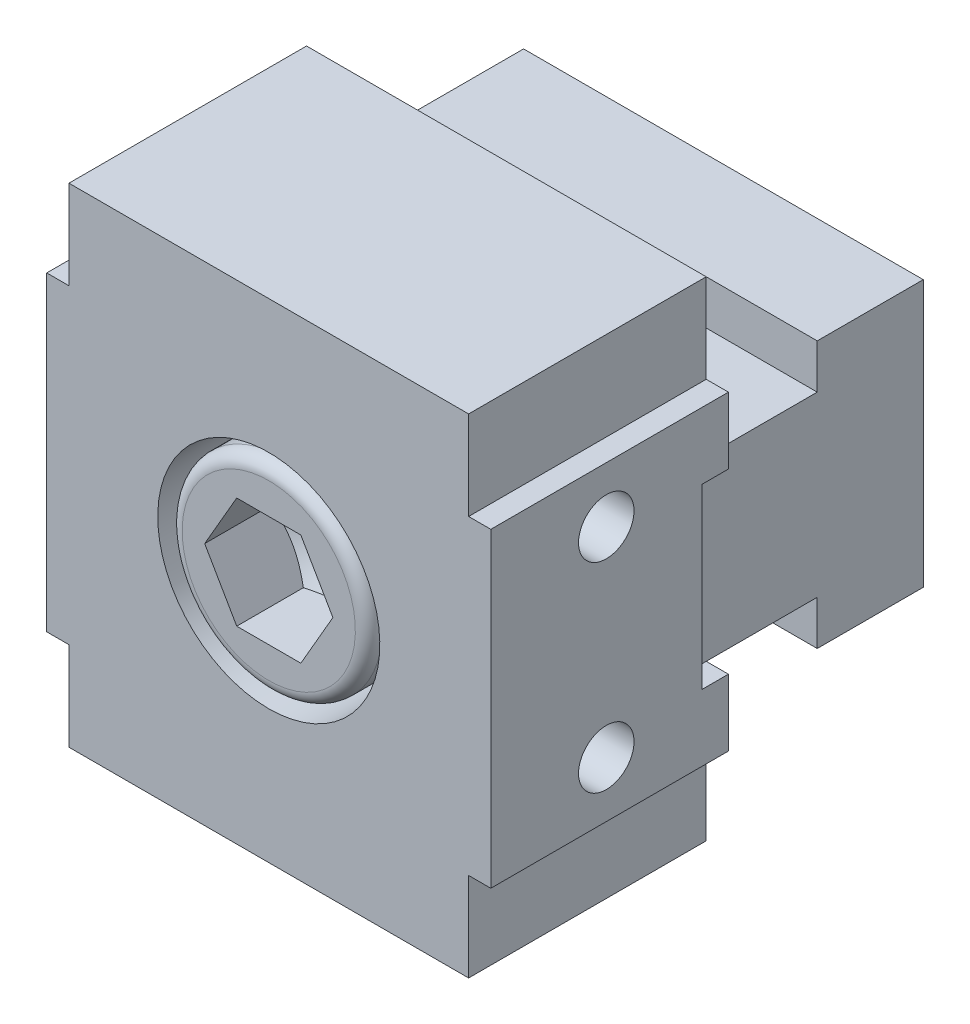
ISO-10303-21;
HEADER;
FILE_DESCRIPTION(('STEP AP214'),'2;1');
FILE_NAME('part.step','',(''),(''),'','','');
FILE_SCHEMA(('AUTOMOTIVE_DESIGN { 1 0 10303 214 1 1 1 1 }'));
ENDSEC;
DATA;
#1=APPLICATION_CONTEXT('core data for automotive mechanical design processes');
#2=APPLICATION_PROTOCOL_DEFINITION('international standard','automotive_design',2000,#1);
#3=PRODUCT_CONTEXT('',#1,'mechanical');
#4=PRODUCT('Part','Part','',(#3));
#5=PRODUCT_RELATED_PRODUCT_CATEGORY('part','',(#4));
#6=PRODUCT_DEFINITION_FORMATION('','',#4);
#7=PRODUCT_DEFINITION_CONTEXT('part definition',#1,'design');
#8=PRODUCT_DEFINITION('design','',#6,#7);
#9=PRODUCT_DEFINITION_SHAPE('','',#8);
#10=(LENGTH_UNIT() NAMED_UNIT(*) SI_UNIT(.MILLI.,.METRE.));
#11=(NAMED_UNIT(*) PLANE_ANGLE_UNIT() SI_UNIT($,.RADIAN.));
#12=(NAMED_UNIT(*) SI_UNIT($,.STERADIAN.) SOLID_ANGLE_UNIT());
#13=UNCERTAINTY_MEASURE_WITH_UNIT(LENGTH_MEASURE(1.E-05),#10,'distance_accuracy_value','');
#14=(GEOMETRIC_REPRESENTATION_CONTEXT(3) GLOBAL_UNCERTAINTY_ASSIGNED_CONTEXT((#13)) GLOBAL_UNIT_ASSIGNED_CONTEXT((#10,
#11,#12)) REPRESENTATION_CONTEXT('',''));
#15=CARTESIAN_POINT('',(0.,0.,0.));
#16=DIRECTION('',(0.,0.,1.));
#17=DIRECTION('',(1.,0.,0.));
#18=AXIS2_PLACEMENT_3D('',#15,#16,#17);
#19=CARTESIAN_POINT('',(0.,0.,-7.7875));
#20=DIRECTION('',(0.,0.,-1.));
#21=DIRECTION('',(0.866025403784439,-0.5,0.));
#22=AXIS2_PLACEMENT_3D('',#19,#20,#21);
#23=CYLINDRICAL_SURFACE('',#22,6.);
#24=CARTESIAN_POINT('',(0.,0.,2.00000000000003));
#25=DIRECTION('',(0.,0.,1.));
#26=DIRECTION('',(0.,-1.,0.));
#27=AXIS2_PLACEMENT_3D('',#24,#25,#26);
#28=CIRCLE('',#27,6.);
#29=CARTESIAN_POINT('',(0.,-6.,2.00000000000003));
#30=VERTEX_POINT('',#29);
#31=EDGE_CURVE('E160',#30,#30,#28,.F.);
#32=ORIENTED_EDGE('',*,*,#31,.F.);
#33=EDGE_LOOP('',(#32));
#34=FACE_BOUND('',#33,.T.);
#35=CARTESIAN_POINT('',(0.,0.,2.4));
#36=DIRECTION('',(0.,0.,1.));
#37=DIRECTION('',(1.,0.,0.));
#38=AXIS2_PLACEMENT_3D('',#35,#36,#37);
#39=CIRCLE('',#38,6.);
#40=CARTESIAN_POINT('',(6.,0.,2.4));
#41=VERTEX_POINT('',#40);
#42=EDGE_CURVE('E18',#41,#41,#39,.F.);
#43=ORIENTED_EDGE('',*,*,#42,.T.);
#44=EDGE_LOOP('',(#43));
#45=FACE_BOUND('',#44,.T.);
#46=ADVANCED_FACE('F14',(#34,#45),#23,.T.);
#47=CARTESIAN_POINT('',(13.,9.,11.));
#48=DIRECTION('',(1.,0.,0.));
#49=DIRECTION('',(0.,0.,1.));
#50=AXIS2_PLACEMENT_3D('',#47,#48,#49);
#51=PLANE('',#50);
#52=CARTESIAN_POINT('',(13.,9.,11.));
#53=DIRECTION('',(1.,0.,0.));
#54=DIRECTION('',(0.,0.,1.));
#55=AXIS2_PLACEMENT_3D('',#52,#53,#54);
#56=CIRCLE('',#55,2.5);
#57=CARTESIAN_POINT('',(13.,9.,13.5));
#58=VERTEX_POINT('',#57);
#59=EDGE_CURVE('E465',#58,#58,#56,.T.);
#60=ORIENTED_EDGE('',*,*,#59,.T.);
#61=EDGE_LOOP('',(#60));
#62=FACE_BOUND('',#61,.T.);
#63=ADVANCED_FACE('F645',(#62),#51,.T.);
#64=CARTESIAN_POINT('',(13.,-9.,11.));
#65=DIRECTION('',(1.,0.,0.));
#66=DIRECTION('',(0.,0.,1.));
#67=AXIS2_PLACEMENT_3D('',#64,#65,#66);
#68=PLANE('',#67);
#69=CARTESIAN_POINT('',(13.,-9.,11.));
#70=DIRECTION('',(1.,0.,0.));
#71=DIRECTION('',(0.,0.,1.));
#72=AXIS2_PLACEMENT_3D('',#69,#70,#71);
#73=CIRCLE('',#72,2.5);
#74=CARTESIAN_POINT('',(13.,-9.,13.5));
#75=VERTEX_POINT('',#74);
#76=EDGE_CURVE('E791',#75,#75,#73,.T.);
#77=ORIENTED_EDGE('',*,*,#76,.T.);
#78=EDGE_LOOP('',(#77));
#79=FACE_BOUND('',#78,.T.);
#80=ADVANCED_FACE('F651',(#79),#68,.T.);
#81=CARTESIAN_POINT('',(-13.,9.,11.));
#82=DIRECTION('',(-1.,0.,0.));
#83=DIRECTION('',(0.,0.,-1.));
#84=AXIS2_PLACEMENT_3D('',#81,#82,#83);
#85=PLANE('',#84);
#86=CARTESIAN_POINT('',(-13.,9.,11.));
#87=DIRECTION('',(-1.,0.,0.));
#88=DIRECTION('',(0.,0.,-1.));
#89=AXIS2_PLACEMENT_3D('',#86,#87,#88);
#90=CIRCLE('',#89,2.5);
#91=CARTESIAN_POINT('',(-13.,9.,8.5));
#92=VERTEX_POINT('',#91);
#93=EDGE_CURVE('E785',#92,#92,#90,.T.);
#94=ORIENTED_EDGE('',*,*,#93,.T.);
#95=EDGE_LOOP('',(#94));
#96=FACE_BOUND('',#95,.T.);
#97=ADVANCED_FACE('F869',(#96),#85,.T.);
#98=CARTESIAN_POINT('',(-13.,-9.,11.));
#99=DIRECTION('',(-1.,0.,0.));
#100=DIRECTION('',(0.,0.,-1.));
#101=AXIS2_PLACEMENT_3D('',#98,#99,#100);
#102=PLANE('',#101);
#103=CARTESIAN_POINT('',(-13.,-9.,11.));
#104=DIRECTION('',(-1.,0.,0.));
#105=DIRECTION('',(0.,0.,-1.));
#106=AXIS2_PLACEMENT_3D('',#103,#104,#105);
#107=CIRCLE('',#106,2.5);
#108=CARTESIAN_POINT('',(-13.,-9.,8.5));
#109=VERTEX_POINT('',#108);
#110=EDGE_CURVE('E777',#109,#109,#107,.T.);
#111=ORIENTED_EDGE('',*,*,#110,.T.);
#112=EDGE_LOOP('',(#111));
#113=FACE_BOUND('',#112,.T.);
#114=ADVANCED_FACE('F860',(#113),#102,.T.);
#115=CARTESIAN_POINT('',(13.,9.,11.));
#116=DIRECTION('',(1.,0.,0.));
#117=DIRECTION('',(0.,0.,1.));
#118=AXIS2_PLACEMENT_3D('',#115,#116,#117);
#119=CYLINDRICAL_SURFACE('',#118,2.5);
#120=ORIENTED_EDGE('',*,*,#59,.F.);
#121=EDGE_LOOP('',(#120));
#122=FACE_BOUND('',#121,.T.);
#123=CARTESIAN_POINT('',(20.,9.,11.));
#124=DIRECTION('',(1.,0.,0.));
#125=DIRECTION('',(0.,0.,1.));
#126=AXIS2_PLACEMENT_3D('',#123,#124,#125);
#127=CIRCLE('',#126,2.5);
#128=CARTESIAN_POINT('',(20.,9.,13.5));
#129=VERTEX_POINT('',#128);
#130=EDGE_CURVE('E794',#129,#129,#127,.T.);
#131=ORIENTED_EDGE('',*,*,#130,.T.);
#132=EDGE_LOOP('',(#131));
#133=FACE_BOUND('',#132,.T.);
#134=ADVANCED_FACE('F801',(#122,#133),#119,.F.);
#135=CARTESIAN_POINT('',(13.,-9.,11.));
#136=DIRECTION('',(1.,0.,0.));
#137=DIRECTION('',(0.,0.,1.));
#138=AXIS2_PLACEMENT_3D('',#135,#136,#137);
#139=CYLINDRICAL_SURFACE('',#138,2.5);
#140=ORIENTED_EDGE('',*,*,#76,.F.);
#141=EDGE_LOOP('',(#140));
#142=FACE_BOUND('',#141,.T.);
#143=CARTESIAN_POINT('',(20.,-9.,11.));
#144=DIRECTION('',(1.,0.,0.));
#145=DIRECTION('',(0.,0.,1.));
#146=AXIS2_PLACEMENT_3D('',#143,#144,#145);
#147=CIRCLE('',#146,2.5);
#148=CARTESIAN_POINT('',(20.,-9.,13.5));
#149=VERTEX_POINT('',#148);
#150=EDGE_CURVE('E788',#149,#149,#147,.T.);
#151=ORIENTED_EDGE('',*,*,#150,.T.);
#152=EDGE_LOOP('',(#151));
#153=FACE_BOUND('',#152,.T.);
#154=ADVANCED_FACE('F859',(#142,#153),#139,.F.);
#155=CARTESIAN_POINT('',(-13.,9.,11.));
#156=DIRECTION('',(-1.,0.,0.));
#157=DIRECTION('',(0.,0.,-1.));
#158=AXIS2_PLACEMENT_3D('',#155,#156,#157);
#159=CYLINDRICAL_SURFACE('',#158,2.5);
#160=ORIENTED_EDGE('',*,*,#93,.F.);
#161=EDGE_LOOP('',(#160));
#162=FACE_BOUND('',#161,.T.);
#163=CARTESIAN_POINT('',(-20.,9.,11.));
#164=DIRECTION('',(-1.,0.,0.));
#165=DIRECTION('',(0.,0.,-1.));
#166=AXIS2_PLACEMENT_3D('',#163,#164,#165);
#167=CIRCLE('',#166,2.5);
#168=CARTESIAN_POINT('',(-20.,9.,8.5));
#169=VERTEX_POINT('',#168);
#170=EDGE_CURVE('E782',#169,#169,#167,.T.);
#171=ORIENTED_EDGE('',*,*,#170,.T.);
#172=EDGE_LOOP('',(#171));
#173=FACE_BOUND('',#172,.T.);
#174=ADVANCED_FACE('F865',(#162,#173),#159,.F.);
#175=CARTESIAN_POINT('',(-13.,-9.,11.));
#176=DIRECTION('',(-1.,0.,0.));
#177=DIRECTION('',(0.,0.,-1.));
#178=AXIS2_PLACEMENT_3D('',#175,#176,#177);
#179=CYLINDRICAL_SURFACE('',#178,2.5);
#180=ORIENTED_EDGE('',*,*,#110,.F.);
#181=EDGE_LOOP('',(#180));
#182=FACE_BOUND('',#181,.T.);
#183=CARTESIAN_POINT('',(-20.,-9.,11.));
#184=DIRECTION('',(-1.,0.,0.));
#185=DIRECTION('',(0.,0.,-1.));
#186=AXIS2_PLACEMENT_3D('',#183,#184,#185);
#187=CIRCLE('',#186,2.5);
#188=CARTESIAN_POINT('',(-20.,-9.,8.5));
#189=VERTEX_POINT('',#188);
#190=EDGE_CURVE('E775',#189,#189,#187,.T.);
#191=ORIENTED_EDGE('',*,*,#190,.T.);
#192=EDGE_LOOP('',(#191));
#193=FACE_BOUND('',#192,.T.);
#194=ADVANCED_FACE('F856',(#182,#193),#179,.F.);
#195=CARTESIAN_POINT('',(-20.,22.,21.4));
#196=DIRECTION('',(0.,0.,1.));
#197=DIRECTION('',(0.,-1.,0.));
#198=AXIS2_PLACEMENT_3D('',#195,#196,#197);
#199=PLANE('',#198);
#200=CARTESIAN_POINT('',(0.,0.,21.4));
#201=DIRECTION('',(0.,0.,1.));
#202=DIRECTION('',(0.,-1.,0.));
#203=AXIS2_PLACEMENT_3D('',#200,#201,#202);
#204=CIRCLE('',#203,10.);
#205=CARTESIAN_POINT('',(0.,-10.,21.4));
#206=VERTEX_POINT('',#205);
#207=EDGE_CURVE('E343',#206,#206,#204,.F.);
#208=ORIENTED_EDGE('',*,*,#207,.T.);
#209=EDGE_LOOP('',(#208));
#210=FACE_BOUND('',#209,.T.);
#211=DIRECTION('',(1.,0.,0.));
#212=VECTOR('',#211,1.);
#213=CARTESIAN_POINT('',(-20.,-22.,21.4));
#214=LINE('',#213,#212);
#215=CARTESIAN_POINT('',(-18.,-22.,21.4));
#216=VERTEX_POINT('',#215);
#217=CARTESIAN_POINT('',(18.,-22.,21.4));
#218=VERTEX_POINT('',#217);
#219=EDGE_CURVE('E328',#216,#218,#214,.T.);
#220=ORIENTED_EDGE('',*,*,#219,.T.);
#221=DIRECTION('',(0.,-1.,0.));
#222=VECTOR('',#221,1.);
#223=CARTESIAN_POINT('',(18.,22.,21.4));
#224=LINE('',#223,#222);
#225=CARTESIAN_POINT('',(18.,-14.,21.4));
#226=VERTEX_POINT('',#225);
#227=EDGE_CURVE('E338',#218,#226,#224,.F.);
#228=ORIENTED_EDGE('',*,*,#227,.T.);
#229=DIRECTION('',(1.,0.,0.));
#230=VECTOR('',#229,1.);
#231=CARTESIAN_POINT('',(-20.,-14.,21.4));
#232=LINE('',#231,#230);
#233=CARTESIAN_POINT('',(20.,-14.,21.4));
#234=VERTEX_POINT('',#233);
#235=EDGE_CURVE('E376',#226,#234,#232,.T.);
#236=ORIENTED_EDGE('',*,*,#235,.T.);
#237=DIRECTION('',(0.,-1.,0.));
#238=VECTOR('',#237,1.);
#239=CARTESIAN_POINT('',(20.,22.,21.4));
#240=LINE('',#239,#238);
#241=CARTESIAN_POINT('',(20.,14.,21.4));
#242=VERTEX_POINT('',#241);
#243=EDGE_CURVE('E373',#234,#242,#240,.F.);
#244=ORIENTED_EDGE('',*,*,#243,.T.);
#245=DIRECTION('',(1.,0.,0.));
#246=VECTOR('',#245,1.);
#247=CARTESIAN_POINT('',(-20.,14.,21.4));
#248=LINE('',#247,#246);
#249=CARTESIAN_POINT('',(18.,14.,21.4));
#250=VERTEX_POINT('',#249);
#251=EDGE_CURVE('E370',#242,#250,#248,.F.);
#252=ORIENTED_EDGE('',*,*,#251,.T.);
#253=DIRECTION('',(0.,-1.,0.));
#254=VECTOR('',#253,1.);
#255=CARTESIAN_POINT('',(18.,22.,21.4));
#256=LINE('',#255,#254);
#257=CARTESIAN_POINT('',(18.,22.,21.4));
#258=VERTEX_POINT('',#257);
#259=EDGE_CURVE('E367',#250,#258,#256,.F.);
#260=ORIENTED_EDGE('',*,*,#259,.T.);
#261=DIRECTION('',(1.,0.,0.));
#262=VECTOR('',#261,1.);
#263=CARTESIAN_POINT('',(-20.,22.,21.4));
#264=LINE('',#263,#262);
#265=CARTESIAN_POINT('',(-18.,22.,21.4));
#266=VERTEX_POINT('',#265);
#267=EDGE_CURVE('E364',#258,#266,#264,.F.);
#268=ORIENTED_EDGE('',*,*,#267,.T.);
#269=DIRECTION('',(0.,-1.,0.));
#270=VECTOR('',#269,1.);
#271=CARTESIAN_POINT('',(-18.,22.,21.4));
#272=LINE('',#271,#270);
#273=CARTESIAN_POINT('',(-18.,14.,21.4));
#274=VERTEX_POINT('',#273);
#275=EDGE_CURVE('E361',#266,#274,#272,.T.);
#276=ORIENTED_EDGE('',*,*,#275,.T.);
#277=DIRECTION('',(1.,0.,0.));
#278=VECTOR('',#277,1.);
#279=CARTESIAN_POINT('',(-20.,14.,21.4));
#280=LINE('',#279,#278);
#281=CARTESIAN_POINT('',(-20.,14.,21.4));
#282=VERTEX_POINT('',#281);
#283=EDGE_CURVE('E358',#274,#282,#280,.F.);
#284=ORIENTED_EDGE('',*,*,#283,.T.);
#285=DIRECTION('',(0.,-1.,0.));
#286=VECTOR('',#285,1.);
#287=CARTESIAN_POINT('',(-20.,22.,21.4));
#288=LINE('',#287,#286);
#289=CARTESIAN_POINT('',(-20.,-14.,21.4));
#290=VERTEX_POINT('',#289);
#291=EDGE_CURVE('E355',#282,#290,#288,.T.);
#292=ORIENTED_EDGE('',*,*,#291,.T.);
#293=DIRECTION('',(1.,0.,0.));
#294=VECTOR('',#293,1.);
#295=CARTESIAN_POINT('',(-20.,-14.,21.4));
#296=LINE('',#295,#294);
#297=CARTESIAN_POINT('',(-18.,-14.,21.4));
#298=VERTEX_POINT('',#297);
#299=EDGE_CURVE('E350',#290,#298,#296,.T.);
#300=ORIENTED_EDGE('',*,*,#299,.T.);
#301=DIRECTION('',(0.,-1.,0.));
#302=VECTOR('',#301,1.);
#303=CARTESIAN_POINT('',(-18.,22.,21.4));
#304=LINE('',#303,#302);
#305=EDGE_CURVE('E348',#298,#216,#304,.T.);
#306=ORIENTED_EDGE('',*,*,#305,.T.);
#307=EDGE_LOOP('',(#220,#228,#236,#244,#252,#260,#268,#276,#284,#292,#300,#306));
#308=FACE_BOUND('',#307,.T.);
#309=ADVANCED_FACE('F345',(#210,#308),#199,.T.);
#310=CARTESIAN_POINT('',(0.,0.,15.4));
#311=DIRECTION('',(0.,0.,1.));
#312=DIRECTION('',(0.,-1.,0.));
#313=AXIS2_PLACEMENT_3D('',#310,#311,#312);
#314=CYLINDRICAL_SURFACE('',#313,10.);
#315=CARTESIAN_POINT('',(0.,0.,9.4));
#316=DIRECTION('',(0.,0.,1.));
#317=DIRECTION('',(0.,-1.,0.));
#318=AXIS2_PLACEMENT_3D('',#315,#316,#317);
#319=CIRCLE('',#318,10.);
#320=CARTESIAN_POINT('',(0.,-10.,9.4));
#321=VERTEX_POINT('',#320);
#322=EDGE_CURVE('E333',#321,#321,#319,.T.);
#323=ORIENTED_EDGE('',*,*,#322,.F.);
#324=EDGE_LOOP('',(#323));
#325=FACE_BOUND('',#324,.T.);
#326=ORIENTED_EDGE('',*,*,#207,.F.);
#327=EDGE_LOOP('',(#326));
#328=FACE_BOUND('',#327,.T.);
#329=ADVANCED_FACE('F818',(#325,#328),#314,.F.);
#330=CARTESIAN_POINT('',(0.,0.,9.4));
#331=DIRECTION('',(0.,0.,1.));
#332=DIRECTION('',(0.,-1.,0.));
#333=AXIS2_PLACEMENT_3D('',#330,#331,#332);
#334=PLANE('',#333);
#335=ORIENTED_EDGE('',*,*,#322,.T.);
#336=EDGE_LOOP('',(#335));
#337=FACE_BOUND('',#336,.T.);
#338=CARTESIAN_POINT('',(0.,0.,9.4));
#339=DIRECTION('',(0.,0.,-1.));
#340=DIRECTION('',(0.866025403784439,-0.5,0.));
#341=AXIS2_PLACEMENT_3D('',#338,#339,#340);
#342=CIRCLE('',#341,9.);
#343=CARTESIAN_POINT('',(7.79422863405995,-4.5,9.4));
#344=VERTEX_POINT('',#343);
#345=EDGE_CURVE('E468',#344,#344,#342,.T.);
#346=ORIENTED_EDGE('',*,*,#345,.T.);
#347=EDGE_LOOP('',(#346));
#348=FACE_BOUND('',#347,.T.);
#349=ADVANCED_FACE('F815',(#337,#348),#334,.T.);
#350=CARTESIAN_POINT('',(-20.,8.,2.4));
#351=DIRECTION('',(0.,0.,1.));
#352=DIRECTION('',(0.,-1.,0.));
#353=AXIS2_PLACEMENT_3D('',#350,#351,#352);
#354=PLANE('',#353);
#355=DIRECTION('',(0.,-1.,0.));
#356=VECTOR('',#355,1.);
#357=CARTESIAN_POINT('',(20.,11.,2.4));
#358=LINE('',#357,#356);
#359=CARTESIAN_POINT('',(20.,-8.,2.4));
#360=VERTEX_POINT('',#359);
#361=CARTESIAN_POINT('',(20.,8.,2.4));
#362=VERTEX_POINT('',#361);
#363=EDGE_CURVE('E439',#360,#362,#358,.F.);
#364=ORIENTED_EDGE('',*,*,#363,.F.);
#365=DIRECTION('',(1.,0.,0.));
#366=VECTOR('',#365,1.);
#367=CARTESIAN_POINT('',(-20.,-8.,2.4));
#368=LINE('',#367,#366);
#369=CARTESIAN_POINT('',(-20.,-8.,2.4));
#370=VERTEX_POINT('',#369);
#371=EDGE_CURVE('E463',#370,#360,#368,.T.);
#372=ORIENTED_EDGE('',*,*,#371,.F.);
#373=DIRECTION('',(0.,-1.,0.));
#374=VECTOR('',#373,1.);
#375=CARTESIAN_POINT('',(-20.,11.,2.4));
#376=LINE('',#375,#374);
#377=CARTESIAN_POINT('',(-20.,8.,2.4));
#378=VERTEX_POINT('',#377);
#379=EDGE_CURVE('E400',#370,#378,#376,.F.);
#380=ORIENTED_EDGE('',*,*,#379,.T.);
#381=DIRECTION('',(1.,0.,0.));
#382=VECTOR('',#381,1.);
#383=CARTESIAN_POINT('',(-20.,8.,2.4));
#384=LINE('',#383,#382);
#385=EDGE_CURVE('E461',#378,#362,#384,.T.);
#386=ORIENTED_EDGE('',*,*,#385,.T.);
#387=EDGE_LOOP('',(#364,#372,#380,#386));
#388=FACE_BOUND('',#387,.T.);
#389=ORIENTED_EDGE('',*,*,#42,.F.);
#390=EDGE_LOOP('',(#389));
#391=FACE_BOUND('',#390,.T.);
#392=ADVANCED_FACE('F739',(#388,#391),#354,.F.);
#393=CARTESIAN_POINT('',(18.,18.,9.9));
#394=DIRECTION('',(1.,0.,0.));
#395=DIRECTION('',(0.,0.,1.));
#396=AXIS2_PLACEMENT_3D('',#393,#394,#395);
#397=PLANE('',#396);
#398=ORIENTED_EDGE('',*,*,#259,.F.);
#399=DIRECTION('',(0.,0.,1.));
#400=VECTOR('',#399,1.);
#401=CARTESIAN_POINT('',(18.,14.,9.9));
#402=LINE('',#401,#400);
#403=CARTESIAN_POINT('',(18.,14.,0.));
#404=VERTEX_POINT('',#403);
#405=EDGE_CURVE('E422',#250,#404,#402,.F.);
#406=ORIENTED_EDGE('',*,*,#405,.T.);
#407=DIRECTION('',(0.,-1.,0.));
#408=VECTOR('',#407,1.);
#409=CARTESIAN_POINT('',(18.,18.,0.));
#410=LINE('',#409,#408);
#411=CARTESIAN_POINT('',(18.,22.,0.));
#412=VERTEX_POINT('',#411);
#413=EDGE_CURVE('E425',#404,#412,#410,.F.);
#414=ORIENTED_EDGE('',*,*,#413,.T.);
#415=DIRECTION('',(0.,0.,1.));
#416=VECTOR('',#415,1.);
#417=CARTESIAN_POINT('',(18.,22.,-1.6));
#418=LINE('',#417,#416);
#419=EDGE_CURVE('E419',#258,#412,#418,.F.);
#420=ORIENTED_EDGE('',*,*,#419,.F.);
#421=EDGE_LOOP('',(#398,#406,#414,#420));
#422=FACE_BOUND('',#421,.T.);
#423=ADVANCED_FACE('F726',(#422),#397,.T.);
#424=CARTESIAN_POINT('',(-20.,22.,-1.6));
#425=DIRECTION('',(0.,1.,0.));
#426=DIRECTION('',(0.,0.,1.));
#427=AXIS2_PLACEMENT_3D('',#424,#425,#426);
#428=PLANE('',#427);
#429=DIRECTION('',(0.,0.,1.));
#430=VECTOR('',#429,1.);
#431=CARTESIAN_POINT('',(-18.,22.,9.9));
#432=LINE('',#431,#430);
#433=CARTESIAN_POINT('',(-18.,22.,0.));
#434=VERTEX_POINT('',#433);
#435=EDGE_CURVE('E415',#434,#266,#432,.T.);
#436=ORIENTED_EDGE('',*,*,#435,.T.);
#437=ORIENTED_EDGE('',*,*,#267,.F.);
#438=ORIENTED_EDGE('',*,*,#419,.T.);
#439=DIRECTION('',(1.,0.,0.));
#440=VECTOR('',#439,1.);
#441=CARTESIAN_POINT('',(-20.,22.,0.));
#442=LINE('',#441,#440);
#443=EDGE_CURVE('E417',#412,#434,#442,.F.);
#444=ORIENTED_EDGE('',*,*,#443,.T.);
#445=EDGE_LOOP('',(#436,#437,#438,#444));
#446=FACE_BOUND('',#445,.T.);
#447=ADVANCED_FACE('F723',(#446),#428,.T.);
#448=CARTESIAN_POINT('',(-18.,18.,9.9));
#449=DIRECTION('',(1.,0.,0.));
#450=DIRECTION('',(0.,0.,1.));
#451=AXIS2_PLACEMENT_3D('',#448,#449,#450);
#452=PLANE('',#451);
#453=DIRECTION('',(0.,0.,-1.));
#454=VECTOR('',#453,1.);
#455=CARTESIAN_POINT('',(-18.,14.,21.4));
#456=LINE('',#455,#454);
#457=CARTESIAN_POINT('',(-18.,14.,0.));
#458=VERTEX_POINT('',#457);
#459=EDGE_CURVE('E410',#458,#274,#456,.F.);
#460=ORIENTED_EDGE('',*,*,#459,.T.);
#461=ORIENTED_EDGE('',*,*,#275,.F.);
#462=ORIENTED_EDGE('',*,*,#435,.F.);
#463=DIRECTION('',(0.,-1.,0.));
#464=VECTOR('',#463,1.);
#465=CARTESIAN_POINT('',(-18.,18.,0.));
#466=LINE('',#465,#464);
#467=EDGE_CURVE('E412',#458,#434,#466,.F.);
#468=ORIENTED_EDGE('',*,*,#467,.F.);
#469=EDGE_LOOP('',(#460,#461,#462,#468));
#470=FACE_BOUND('',#469,.T.);
#471=ADVANCED_FACE('F720',(#470),#452,.F.);
#472=CARTESIAN_POINT('',(-20.,14.,21.4));
#473=DIRECTION('',(0.,-1.,0.));
#474=DIRECTION('',(0.,0.,-1.));
#475=AXIS2_PLACEMENT_3D('',#472,#473,#474);
#476=PLANE('',#475);
#477=DIRECTION('',(0.,0.,1.));
#478=VECTOR('',#477,1.);
#479=CARTESIAN_POINT('',(-20.,14.,9.9));
#480=LINE('',#479,#478);
#481=CARTESIAN_POINT('',(-20.,14.,0.));
#482=VERTEX_POINT('',#481);
#483=EDGE_CURVE('E394',#482,#282,#480,.T.);
#484=ORIENTED_EDGE('',*,*,#483,.T.);
#485=ORIENTED_EDGE('',*,*,#283,.F.);
#486=ORIENTED_EDGE('',*,*,#459,.F.);
#487=DIRECTION('',(1.,0.,0.));
#488=VECTOR('',#487,1.);
#489=CARTESIAN_POINT('',(-20.,14.,0.));
#490=LINE('',#489,#488);
#491=EDGE_CURVE('E407',#482,#458,#490,.T.);
#492=ORIENTED_EDGE('',*,*,#491,.F.);
#493=EDGE_LOOP('',(#484,#485,#486,#492));
#494=FACE_BOUND('',#493,.T.);
#495=ADVANCED_FACE('F714',(#494),#476,.F.);
#496=CARTESIAN_POINT('',(-20.,8.,-1.6));
#497=DIRECTION('',(0.,1.,0.));
#498=DIRECTION('',(0.,0.,1.));
#499=AXIS2_PLACEMENT_3D('',#496,#497,#498);
#500=PLANE('',#499);
#501=DIRECTION('',(1.,0.,0.));
#502=VECTOR('',#501,1.);
#503=CARTESIAN_POINT('',(-20.,8.,2.00000000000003));
#504=LINE('',#503,#502);
#505=CARTESIAN_POINT('',(-18.,8.,2.00000000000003));
#506=VERTEX_POINT('',#505);
#507=CARTESIAN_POINT('',(18.,8.,2.00000000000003));
#508=VERTEX_POINT('',#507);
#509=EDGE_CURVE('E211',#506,#508,#504,.T.);
#510=ORIENTED_EDGE('',*,*,#509,.T.);
#511=DIRECTION('',(0.,0.,-1.));
#512=VECTOR('',#511,1.);
#513=CARTESIAN_POINT('',(18.,8.,-1.6));
#514=LINE('',#513,#512);
#515=CARTESIAN_POINT('',(18.,8.,0.));
#516=VERTEX_POINT('',#515);
#517=EDGE_CURVE('E204',#508,#516,#514,.T.);
#518=ORIENTED_EDGE('',*,*,#517,.T.);
#519=DIRECTION('',(1.,0.,0.));
#520=VECTOR('',#519,1.);
#521=CARTESIAN_POINT('',(-20.,8.,0.));
#522=LINE('',#521,#520);
#523=CARTESIAN_POINT('',(20.,8.,0.));
#524=VERTEX_POINT('',#523);
#525=EDGE_CURVE('E460',#516,#524,#522,.T.);
#526=ORIENTED_EDGE('',*,*,#525,.T.);
#527=DIRECTION('',(0.,0.,1.));
#528=VECTOR('',#527,1.);
#529=CARTESIAN_POINT('',(20.,8.,9.9));
#530=LINE('',#529,#528);
#531=EDGE_CURVE('E436',#362,#524,#530,.F.);
#532=ORIENTED_EDGE('',*,*,#531,.F.);
#533=ORIENTED_EDGE('',*,*,#385,.F.);
#534=DIRECTION('',(0.,0.,1.));
#535=VECTOR('',#534,1.);
#536=CARTESIAN_POINT('',(-20.,8.,9.9));
#537=LINE('',#536,#535);
#538=CARTESIAN_POINT('',(-20.,8.,0.));
#539=VERTEX_POINT('',#538);
#540=EDGE_CURVE('E398',#378,#539,#537,.F.);
#541=ORIENTED_EDGE('',*,*,#540,.T.);
#542=CARTESIAN_POINT('',(-18.,8.,0.));
#543=VERTEX_POINT('',#542);
#544=EDGE_CURVE('E457',#539,#543,#522,.T.);
#545=ORIENTED_EDGE('',*,*,#544,.T.);
#546=DIRECTION('',(0.,0.,1.));
#547=VECTOR('',#546,1.);
#548=CARTESIAN_POINT('',(-18.,8.,-1.6));
#549=LINE('',#548,#547);
#550=EDGE_CURVE('E472',#543,#506,#549,.T.);
#551=ORIENTED_EDGE('',*,*,#550,.T.);
#552=EDGE_LOOP('',(#510,#518,#526,#532,#533,#541,#545,#551));
#553=FACE_BOUND('',#552,.T.);
#554=ADVANCED_FACE('F701',(#553),#500,.F.);
#555=CARTESIAN_POINT('',(20.,-14.,-1.6));
#556=DIRECTION('',(0.,-1.,0.));
#557=DIRECTION('',(0.,0.,-1.));
#558=AXIS2_PLACEMENT_3D('',#555,#556,#557);
#559=PLANE('',#558);
#560=ORIENTED_EDGE('',*,*,#235,.F.);
#561=DIRECTION('',(0.,0.,1.));
#562=VECTOR('',#561,1.);
#563=CARTESIAN_POINT('',(18.,-14.,9.9));
#564=LINE('',#563,#562);
#565=CARTESIAN_POINT('',(18.,-14.,0.));
#566=VERTEX_POINT('',#565);
#567=EDGE_CURVE('E334',#566,#226,#564,.T.);
#568=ORIENTED_EDGE('',*,*,#567,.F.);
#569=DIRECTION('',(1.,0.,0.));
#570=VECTOR('',#569,1.);
#571=CARTESIAN_POINT('',(20.,-14.,0.));
#572=LINE('',#571,#570);
#573=CARTESIAN_POINT('',(20.,-14.,0.));
#574=VERTEX_POINT('',#573);
#575=EDGE_CURVE('E451',#566,#574,#572,.T.);
#576=ORIENTED_EDGE('',*,*,#575,.T.);
#577=DIRECTION('',(0.,0.,1.));
#578=VECTOR('',#577,1.);
#579=CARTESIAN_POINT('',(20.,-14.,9.9));
#580=LINE('',#579,#578);
#581=EDGE_CURVE('E448',#234,#574,#580,.F.);
#582=ORIENTED_EDGE('',*,*,#581,.F.);
#583=EDGE_LOOP('',(#560,#568,#576,#582));
#584=FACE_BOUND('',#583,.T.);
#585=ADVANCED_FACE('F753',(#584),#559,.T.);
#586=CARTESIAN_POINT('',(20.,11.,9.9));
#587=DIRECTION('',(1.,0.,0.));
#588=DIRECTION('',(0.,0.,1.));
#589=AXIS2_PLACEMENT_3D('',#586,#587,#588);
#590=PLANE('',#589);
#591=ORIENTED_EDGE('',*,*,#150,.F.);
#592=EDGE_LOOP('',(#591));
#593=FACE_BOUND('',#592,.T.);
#594=ORIENTED_EDGE('',*,*,#130,.F.);
#595=EDGE_LOOP('',(#594));
#596=FACE_BOUND('',#595,.T.);
#597=DIRECTION('',(0.,0.,1.));
#598=VECTOR('',#597,1.);
#599=CARTESIAN_POINT('',(20.,14.,21.4));
#600=LINE('',#599,#598);
#601=CARTESIAN_POINT('',(20.,14.,0.));
#602=VERTEX_POINT('',#601);
#603=EDGE_CURVE('E427',#242,#602,#600,.F.);
#604=ORIENTED_EDGE('',*,*,#603,.F.);
#605=ORIENTED_EDGE('',*,*,#243,.F.);
#606=ORIENTED_EDGE('',*,*,#581,.T.);
#607=DIRECTION('',(0.,-1.,0.));
#608=VECTOR('',#607,1.);
#609=CARTESIAN_POINT('',(20.,11.,0.));
#610=LINE('',#609,#608);
#611=CARTESIAN_POINT('',(20.,-8.,0.));
#612=VERTEX_POINT('',#611);
#613=EDGE_CURVE('E445',#574,#612,#610,.F.);
#614=ORIENTED_EDGE('',*,*,#613,.T.);
#615=DIRECTION('',(0.,0.,1.));
#616=VECTOR('',#615,1.);
#617=CARTESIAN_POINT('',(20.,-8.,9.9));
#618=LINE('',#617,#616);
#619=EDGE_CURVE('E442',#612,#360,#618,.T.);
#620=ORIENTED_EDGE('',*,*,#619,.T.);
#621=ORIENTED_EDGE('',*,*,#363,.T.);
#622=ORIENTED_EDGE('',*,*,#531,.T.);
#623=DIRECTION('',(0.,-1.,0.));
#624=VECTOR('',#623,1.);
#625=CARTESIAN_POINT('',(20.,11.,0.));
#626=LINE('',#625,#624);
#627=EDGE_CURVE('E433',#524,#602,#626,.F.);
#628=ORIENTED_EDGE('',*,*,#627,.T.);
#629=EDGE_LOOP('',(#604,#605,#606,#614,#620,#621,#622,#628));
#630=FACE_BOUND('',#629,.T.);
#631=ADVANCED_FACE('F733',(#593,#596,#630),#590,.T.);
#632=CARTESIAN_POINT('',(-20.,-8.,-1.6));
#633=DIRECTION('',(0.,1.,0.));
#634=DIRECTION('',(0.,0.,1.));
#635=AXIS2_PLACEMENT_3D('',#632,#633,#634);
#636=PLANE('',#635);
#637=DIRECTION('',(0.,0.,1.));
#638=VECTOR('',#637,1.);
#639=CARTESIAN_POINT('',(18.,-8.,-9.49031612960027));
#640=LINE('',#639,#638);
#641=CARTESIAN_POINT('',(18.,-8.,2.00000000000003));
#642=VERTEX_POINT('',#641);
#643=CARTESIAN_POINT('',(18.,-8.,0.));
#644=VERTEX_POINT('',#643);
#645=EDGE_CURVE('E9',#642,#644,#640,.F.);
#646=ORIENTED_EDGE('',*,*,#645,.F.);
#647=DIRECTION('',(1.,0.,0.));
#648=VECTOR('',#647,1.);
#649=CARTESIAN_POINT('',(-20.,-8.,2.00000000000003));
#650=LINE('',#649,#648);
#651=CARTESIAN_POINT('',(-18.,-8.,2.00000000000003));
#652=VERTEX_POINT('',#651);
#653=EDGE_CURVE('E212',#652,#642,#650,.T.);
#654=ORIENTED_EDGE('',*,*,#653,.F.);
#655=DIRECTION('',(0.,0.,1.));
#656=VECTOR('',#655,1.);
#657=CARTESIAN_POINT('',(-18.,-8.,-1.6));
#658=LINE('',#657,#656);
#659=CARTESIAN_POINT('',(-18.,-8.,0.));
#660=VERTEX_POINT('',#659);
#661=EDGE_CURVE('E24',#660,#652,#658,.T.);
#662=ORIENTED_EDGE('',*,*,#661,.F.);
#663=DIRECTION('',(1.,0.,0.));
#664=VECTOR('',#663,1.);
#665=CARTESIAN_POINT('',(-20.,-8.,0.));
#666=LINE('',#665,#664);
#667=CARTESIAN_POINT('',(-20.,-8.,0.));
#668=VERTEX_POINT('',#667);
#669=EDGE_CURVE('E456',#660,#668,#666,.F.);
#670=ORIENTED_EDGE('',*,*,#669,.T.);
#671=DIRECTION('',(0.,0.,1.));
#672=VECTOR('',#671,1.);
#673=CARTESIAN_POINT('',(-20.,-8.,9.9));
#674=LINE('',#673,#672);
#675=EDGE_CURVE('E402',#668,#370,#674,.T.);
#676=ORIENTED_EDGE('',*,*,#675,.T.);
#677=ORIENTED_EDGE('',*,*,#371,.T.);
#678=ORIENTED_EDGE('',*,*,#619,.F.);
#679=EDGE_CURVE('E453',#612,#644,#666,.F.);
#680=ORIENTED_EDGE('',*,*,#679,.T.);
#681=EDGE_LOOP('',(#646,#654,#662,#670,#676,#677,#678,#680));
#682=FACE_BOUND('',#681,.T.);
#683=ADVANCED_FACE('F658',(#682),#636,.T.);
#684=CARTESIAN_POINT('',(-20.,11.,9.9));
#685=DIRECTION('',(1.,0.,0.));
#686=DIRECTION('',(0.,0.,1.));
#687=AXIS2_PLACEMENT_3D('',#684,#685,#686);
#688=PLANE('',#687);
#689=ORIENTED_EDGE('',*,*,#190,.F.);
#690=EDGE_LOOP('',(#689));
#691=FACE_BOUND('',#690,.T.);
#692=ORIENTED_EDGE('',*,*,#170,.F.);
#693=EDGE_LOOP('',(#692));
#694=FACE_BOUND('',#693,.T.);
#695=DIRECTION('',(0.,-1.,0.));
#696=VECTOR('',#695,1.);
#697=CARTESIAN_POINT('',(-20.,11.,0.));
#698=LINE('',#697,#696);
#699=EDGE_CURVE('E396',#539,#482,#698,.F.);
#700=ORIENTED_EDGE('',*,*,#699,.F.);
#701=ORIENTED_EDGE('',*,*,#540,.F.);
#702=ORIENTED_EDGE('',*,*,#379,.F.);
#703=ORIENTED_EDGE('',*,*,#675,.F.);
#704=DIRECTION('',(0.,-1.,0.));
#705=VECTOR('',#704,1.);
#706=CARTESIAN_POINT('',(-20.,11.,0.));
#707=LINE('',#706,#705);
#708=CARTESIAN_POINT('',(-20.,-14.,0.));
#709=VERTEX_POINT('',#708);
#710=EDGE_CURVE('E404',#709,#668,#707,.F.);
#711=ORIENTED_EDGE('',*,*,#710,.F.);
#712=DIRECTION('',(0.,0.,1.));
#713=VECTOR('',#712,1.);
#714=CARTESIAN_POINT('',(-20.,-14.,-1.6));
#715=LINE('',#714,#713);
#716=EDGE_CURVE('E392',#709,#290,#715,.T.);
#717=ORIENTED_EDGE('',*,*,#716,.T.);
#718=ORIENTED_EDGE('',*,*,#291,.F.);
#719=ORIENTED_EDGE('',*,*,#483,.F.);
#720=EDGE_LOOP('',(#700,#701,#702,#703,#711,#717,#718,#719));
#721=FACE_BOUND('',#720,.T.);
#722=ADVANCED_FACE('F709',(#691,#694,#721),#688,.F.);
#723=CARTESIAN_POINT('',(-20.,-14.,-1.6));
#724=DIRECTION('',(0.,1.,0.));
#725=DIRECTION('',(0.,0.,1.));
#726=AXIS2_PLACEMENT_3D('',#723,#724,#725);
#727=PLANE('',#726);
#728=DIRECTION('',(0.,0.,1.));
#729=VECTOR('',#728,1.);
#730=CARTESIAN_POINT('',(-18.,-14.,9.9));
#731=LINE('',#730,#729);
#732=CARTESIAN_POINT('',(-18.,-14.,0.));
#733=VERTEX_POINT('',#732);
#734=EDGE_CURVE('E387',#733,#298,#731,.T.);
#735=ORIENTED_EDGE('',*,*,#734,.T.);
#736=ORIENTED_EDGE('',*,*,#299,.F.);
#737=ORIENTED_EDGE('',*,*,#716,.F.);
#738=DIRECTION('',(1.,0.,0.));
#739=VECTOR('',#738,1.);
#740=CARTESIAN_POINT('',(-20.,-14.,0.));
#741=LINE('',#740,#739);
#742=EDGE_CURVE('E389',#733,#709,#741,.F.);
#743=ORIENTED_EDGE('',*,*,#742,.F.);
#744=EDGE_LOOP('',(#735,#736,#737,#743));
#745=FACE_BOUND('',#744,.T.);
#746=ADVANCED_FACE('F751',(#745),#727,.F.);
#747=CARTESIAN_POINT('',(-18.,-18.,9.9));
#748=DIRECTION('',(1.,0.,0.));
#749=DIRECTION('',(0.,0.,1.));
#750=AXIS2_PLACEMENT_3D('',#747,#748,#749);
#751=PLANE('',#750);
#752=DIRECTION('',(0.,0.,1.));
#753=VECTOR('',#752,1.);
#754=CARTESIAN_POINT('',(-18.,-22.,-1.6));
#755=LINE('',#754,#753);
#756=CARTESIAN_POINT('',(-18.,-22.,0.));
#757=VERTEX_POINT('',#756);
#758=EDGE_CURVE('E381',#757,#216,#755,.T.);
#759=ORIENTED_EDGE('',*,*,#758,.T.);
#760=ORIENTED_EDGE('',*,*,#305,.F.);
#761=ORIENTED_EDGE('',*,*,#734,.F.);
#762=DIRECTION('',(0.,-1.,0.));
#763=VECTOR('',#762,1.);
#764=CARTESIAN_POINT('',(-18.,-18.,0.));
#765=LINE('',#764,#763);
#766=EDGE_CURVE('E384',#757,#733,#765,.F.);
#767=ORIENTED_EDGE('',*,*,#766,.F.);
#768=EDGE_LOOP('',(#759,#760,#761,#767));
#769=FACE_BOUND('',#768,.T.);
#770=ADVANCED_FACE('F843',(#769),#751,.F.);
#771=CARTESIAN_POINT('',(-20.,-22.,-1.6));
#772=DIRECTION('',(0.,1.,0.));
#773=DIRECTION('',(0.,0.,1.));
#774=AXIS2_PLACEMENT_3D('',#771,#772,#773);
#775=PLANE('',#774);
#776=ORIENTED_EDGE('',*,*,#219,.F.);
#777=ORIENTED_EDGE('',*,*,#758,.F.);
#778=DIRECTION('',(1.,0.,0.));
#779=VECTOR('',#778,1.);
#780=CARTESIAN_POINT('',(-20.,-22.,0.));
#781=LINE('',#780,#779);
#782=CARTESIAN_POINT('',(18.,-22.,0.));
#783=VERTEX_POINT('',#782);
#784=EDGE_CURVE('E330',#783,#757,#781,.F.);
#785=ORIENTED_EDGE('',*,*,#784,.F.);
#786=DIRECTION('',(0.,0.,1.));
#787=VECTOR('',#786,1.);
#788=CARTESIAN_POINT('',(18.,-22.,9.9));
#789=LINE('',#788,#787);
#790=EDGE_CURVE('E323',#218,#783,#789,.F.);
#791=ORIENTED_EDGE('',*,*,#790,.F.);
#792=EDGE_LOOP('',(#776,#777,#785,#791));
#793=FACE_BOUND('',#792,.T.);
#794=ADVANCED_FACE('F325',(#793),#775,.F.);
#795=CARTESIAN_POINT('',(18.,-18.,9.9));
#796=DIRECTION('',(1.,0.,0.));
#797=DIRECTION('',(0.,0.,1.));
#798=AXIS2_PLACEMENT_3D('',#795,#796,#797);
#799=PLANE('',#798);
#800=ORIENTED_EDGE('',*,*,#227,.F.);
#801=ORIENTED_EDGE('',*,*,#790,.T.);
#802=DIRECTION('',(0.,-1.,0.));
#803=VECTOR('',#802,1.);
#804=CARTESIAN_POINT('',(18.,-18.,0.));
#805=LINE('',#804,#803);
#806=EDGE_CURVE('E379',#783,#566,#805,.F.);
#807=ORIENTED_EDGE('',*,*,#806,.T.);
#808=ORIENTED_EDGE('',*,*,#567,.T.);
#809=EDGE_LOOP('',(#800,#801,#807,#808));
#810=FACE_BOUND('',#809,.T.);
#811=ADVANCED_FACE('F339',(#810),#799,.T.);
#812=CARTESIAN_POINT('',(-20.,-22.,0.));
#813=DIRECTION('',(0.,0.,1.));
#814=DIRECTION('',(0.,-1.,0.));
#815=AXIS2_PLACEMENT_3D('',#812,#813,#814);
#816=PLANE('',#815);
#817=ORIENTED_EDGE('',*,*,#806,.F.);
#818=ORIENTED_EDGE('',*,*,#784,.T.);
#819=ORIENTED_EDGE('',*,*,#766,.T.);
#820=ORIENTED_EDGE('',*,*,#742,.T.);
#821=ORIENTED_EDGE('',*,*,#710,.T.);
#822=ORIENTED_EDGE('',*,*,#669,.F.);
#823=EDGE_CURVE('E455',#644,#660,#666,.F.);
#824=ORIENTED_EDGE('',*,*,#823,.F.);
#825=ORIENTED_EDGE('',*,*,#679,.F.);
#826=ORIENTED_EDGE('',*,*,#613,.F.);
#827=ORIENTED_EDGE('',*,*,#575,.F.);
#828=EDGE_LOOP('',(#817,#818,#819,#820,#821,#822,#824,#825,#826,#827));
#829=FACE_BOUND('',#828,.T.);
#830=ADVANCED_FACE('F745',(#829),#816,.F.);
#831=CARTESIAN_POINT('',(20.,14.,21.4));
#832=DIRECTION('',(0.,1.,0.));
#833=DIRECTION('',(0.,0.,1.));
#834=AXIS2_PLACEMENT_3D('',#831,#832,#833);
#835=PLANE('',#834);
#836=ORIENTED_EDGE('',*,*,#251,.F.);
#837=ORIENTED_EDGE('',*,*,#603,.T.);
#838=DIRECTION('',(1.,0.,0.));
#839=VECTOR('',#838,1.);
#840=CARTESIAN_POINT('',(20.,14.,0.));
#841=LINE('',#840,#839);
#842=EDGE_CURVE('E430',#602,#404,#841,.F.);
#843=ORIENTED_EDGE('',*,*,#842,.T.);
#844=ORIENTED_EDGE('',*,*,#405,.F.);
#845=EDGE_LOOP('',(#836,#837,#843,#844));
#846=FACE_BOUND('',#845,.T.);
#847=ADVANCED_FACE('F730',(#846),#835,.T.);
#848=CARTESIAN_POINT('',(-20.,-22.,0.));
#849=DIRECTION('',(0.,0.,1.));
#850=DIRECTION('',(0.,-1.,0.));
#851=AXIS2_PLACEMENT_3D('',#848,#849,#850);
#852=PLANE('',#851);
#853=ORIENTED_EDGE('',*,*,#842,.F.);
#854=ORIENTED_EDGE('',*,*,#627,.F.);
#855=ORIENTED_EDGE('',*,*,#525,.F.);
#856=EDGE_CURVE('E136',#543,#516,#522,.T.);
#857=ORIENTED_EDGE('',*,*,#856,.F.);
#858=ORIENTED_EDGE('',*,*,#544,.F.);
#859=ORIENTED_EDGE('',*,*,#699,.T.);
#860=ORIENTED_EDGE('',*,*,#491,.T.);
#861=ORIENTED_EDGE('',*,*,#467,.T.);
#862=ORIENTED_EDGE('',*,*,#443,.F.);
#863=ORIENTED_EDGE('',*,*,#413,.F.);
#864=EDGE_LOOP('',(#853,#854,#855,#857,#858,#859,#860,#861,#862,#863));
#865=FACE_BOUND('',#864,.T.);
#866=ADVANCED_FACE('F601',(#865),#852,.F.);
#867=CARTESIAN_POINT('',(0.,0.,15.4199999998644));
#868=DIRECTION('',(0.,0.,1.));
#869=DIRECTION('',(-0.5,-0.866025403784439,0.));
#870=AXIS2_PLACEMENT_3D('',#867,#868,#869);
#871=CONICAL_SURFACE('',#870,5.80814370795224,1.04719755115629);
#872=CARTESIAN_POINT('',(-9.84598687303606E-11,5.68436357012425E-11,12.0666666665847));
#873=VERTEX_POINT('',#872);
#874=VERTEX_LOOP('',#873);
#875=FACE_BOUND('',#874,.T.);
#876=CARTESIAN_POINT('',(2.88675134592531,-5.00000000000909,15.3999999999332));
#877=CARTESIAN_POINT('',(3.01361322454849,-4.78026878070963,15.3267433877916));
#878=CARTESIAN_POINT('',(3.14156016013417,-4.55865818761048,15.2601139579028));
#879=CARTESIAN_POINT('',(3.39966938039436,-4.1115999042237,15.1438136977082));
#880=CARTESIAN_POINT('',(3.5298362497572,-3.8861442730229,15.0941840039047));
#881=CARTESIAN_POINT('',(3.78857671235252,-3.43799264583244,15.0169443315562));
#882=CARTESIAN_POINT('',(3.91711001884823,-3.21536642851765,14.9888198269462));
#883=CARTESIAN_POINT('',(4.11036193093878,-2.88064429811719,14.9636032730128));
#884=CARTESIAN_POINT('',(4.17482329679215,-2.76899393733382,14.9580247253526));
#885=CARTESIAN_POINT('',(4.30380553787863,-2.54559014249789,14.9526191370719));
#886=CARTESIAN_POINT('',(4.36832641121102,-2.43383671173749,14.9527919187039));
#887=CARTESIAN_POINT('',(4.54508051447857,-2.12768962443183,14.9611797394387));
#888=CARTESIAN_POINT('',(4.65725513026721,-1.93339749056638,14.975256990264));
#889=CARTESIAN_POINT('',(4.88085989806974,-1.54610267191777,15.0198894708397));
#890=CARTESIAN_POINT('',(4.99228926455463,-1.35310134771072,15.0504599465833));
#891=CARTESIAN_POINT('',(5.21634426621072,-0.965026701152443,15.1268756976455));
#892=CARTESIAN_POINT('',(5.32894163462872,-0.770002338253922,15.1730446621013));
#893=CARTESIAN_POINT('',(5.55245747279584,-0.382861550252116,15.2778288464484));
#894=CARTESIAN_POINT('',(5.6633788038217,-0.19074016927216,15.3364194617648));
#895=CARTESIAN_POINT('',(5.77350269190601,1.69063981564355E-11,15.3999999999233));
#896=B_SPLINE_CURVE_WITH_KNOTS('',3,(#876,#877,#878,#879,#880,#881,#882,#883,#884,#885,#886,
#887,#888,#889,#890,#891,#892,#893,#894,#895),.UNSPECIFIED.,.F.,.F.,(4,2,2,2,2,2,2,2,2,4),(0.,
0.792540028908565,1.58698454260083,2.36176901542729,2.74878733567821,3.13579369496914,
3.80946092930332,4.48375195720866,5.17299552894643,5.86088640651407),.UNSPECIFIED.);
#897=CARTESIAN_POINT('',(2.88675134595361,-5.0000000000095,15.399999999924));
#898=VERTEX_POINT('',#897);
#899=CARTESIAN_POINT('',(5.77350269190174,9.50216468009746E-12,15.3999999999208));
#900=VERTEX_POINT('',#899);
#901=EDGE_CURVE('E165',#898,#900,#896,.T.);
#902=ORIENTED_EDGE('',*,*,#901,.T.);
#903=CARTESIAN_POINT('',(5.77350269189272,-2.43015243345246E-11,15.3999999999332));
#904=CARTESIAN_POINT('',(5.64664081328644,0.219731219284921,15.3267433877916));
#905=CARTESIAN_POINT('',(5.51869387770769,0.441341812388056,15.2601139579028));
#906=CARTESIAN_POINT('',(5.26058465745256,0.888400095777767,15.1438136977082));
#907=CARTESIAN_POINT('',(5.13041778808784,1.11385572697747,15.0941840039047));
#908=CARTESIAN_POINT('',(4.87167732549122,1.56200735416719,15.0169443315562));
#909=CARTESIAN_POINT('',(4.74314401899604,1.78463357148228,14.9888198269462));
#910=CARTESIAN_POINT('',(4.54989210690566,2.11935570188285,14.9636032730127));
#911=CARTESIAN_POINT('',(4.48543074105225,2.23100606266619,14.9580247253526));
#912=CARTESIAN_POINT('',(4.35644849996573,2.4544098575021,14.9526191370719));
#913=CARTESIAN_POINT('',(4.29192762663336,2.56616328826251,14.9527919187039));
#914=CARTESIAN_POINT('',(4.11517352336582,2.87231037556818,14.9611797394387));
#915=CARTESIAN_POINT('',(4.00299890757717,3.06660250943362,14.975256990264));
#916=CARTESIAN_POINT('',(3.77939413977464,3.45389732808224,15.0198894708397));
#917=CARTESIAN_POINT('',(3.66796477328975,3.64689865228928,15.0504599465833));
#918=CARTESIAN_POINT('',(3.44390977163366,4.03497329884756,15.1268756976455));
#919=CARTESIAN_POINT('',(3.33131240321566,4.22999766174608,15.1730446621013));
#920=CARTESIAN_POINT('',(3.10779656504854,4.61713844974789,15.2778288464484));
#921=CARTESIAN_POINT('',(2.99687523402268,4.80925983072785,15.3364194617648));
#922=CARTESIAN_POINT('',(2.88675134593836,5.00000000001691,15.3999999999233));
#923=B_SPLINE_CURVE_WITH_KNOTS('',3,(#903,#904,#905,#906,#907,#908,#909,#910,#911,#912,#913,
#914,#915,#916,#917,#918,#919,#920,#921,#922),.UNSPECIFIED.,.F.,.F.,(4,2,2,2,2,2,2,2,2,4),(0.,
0.792540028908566,1.58698454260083,2.36176901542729,2.74878733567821,3.13579369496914,
3.80946092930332,4.48375195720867,5.17299552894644,5.86088640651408),.UNSPECIFIED.);
#924=CARTESIAN_POINT('',(2.8867513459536,5.0000000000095,15.399999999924));
#925=VERTEX_POINT('',#924);
#926=EDGE_CURVE('E519',#900,#925,#923,.T.);
#927=ORIENTED_EDGE('',*,*,#926,.T.);
#928=CARTESIAN_POINT('',(2.8867513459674,4.99999999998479,15.3999999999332));
#929=CARTESIAN_POINT('',(2.63302758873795,4.99999999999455,15.3267433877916));
#930=CARTESIAN_POINT('',(2.37713371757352,4.99999999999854,15.2601139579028));
#931=CARTESIAN_POINT('',(1.8609152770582,5.00000000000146,15.1438136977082));
#932=CARTESIAN_POINT('',(1.60058153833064,5.00000000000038,15.0941840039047));
#933=CARTESIAN_POINT('',(1.08310061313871,4.99999999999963,15.0169443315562));
#934=CARTESIAN_POINT('',(0.826034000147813,4.99999999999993,14.9888198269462));
#935=CARTESIAN_POINT('',(0.439530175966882,5.00000000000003,14.9636032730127));
#936=CARTESIAN_POINT('',(0.31060744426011,5.00000000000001,14.9580247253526));
#937=CARTESIAN_POINT('',(0.0526429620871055,4.99999999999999,14.9526191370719));
#938=CARTESIAN_POINT('',(-0.0763987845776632,5.,14.9527919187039));
#939=CARTESIAN_POINT('',(-0.429906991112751,5.00000000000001,14.9611797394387));
#940=CARTESIAN_POINT('',(-0.654256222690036,5.,14.975256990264));
#941=CARTESIAN_POINT('',(-1.10146575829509,5.,15.0198894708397));
#942=CARTESIAN_POINT('',(-1.32432449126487,5.,15.0504599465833));
#943=CARTESIAN_POINT('',(-1.77243449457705,5.,15.1268756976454));
#944=CARTESIAN_POINT('',(-1.99762923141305,5.,15.1730446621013));
#945=CARTESIAN_POINT('',(-2.4446609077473,5.,15.2778288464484));
#946=CARTESIAN_POINT('',(-2.66650356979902,5.,15.3364194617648));
#947=CARTESIAN_POINT('',(-2.88675134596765,5.,15.3999999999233));
#948=B_SPLINE_CURVE_WITH_KNOTS('',3,(#928,#929,#930,#931,#932,#933,#934,#935,#936,#937,#938,
#939,#940,#941,#942,#943,#944,#945,#946,#947),.UNSPECIFIED.,.F.,.F.,(4,2,2,2,2,2,2,2,2,4),(0.,
0.792540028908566,1.58698454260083,2.36176901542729,2.74878733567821,3.13579369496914,
3.80946092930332,4.48375195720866,5.17299552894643,5.86088640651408),.UNSPECIFIED.);
#949=CARTESIAN_POINT('',(-2.88675134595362,5.0000000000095,15.399999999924));
#950=VERTEX_POINT('',#949);
#951=EDGE_CURVE('E524',#925,#950,#948,.T.);
#952=ORIENTED_EDGE('',*,*,#951,.T.);
#953=CARTESIAN_POINT('',(-2.88675134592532,5.00000000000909,15.3999999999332));
#954=CARTESIAN_POINT('',(-3.0136132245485,4.78026878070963,15.3267433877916));
#955=CARTESIAN_POINT('',(-3.14156016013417,4.55865818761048,15.2601139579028));
#956=CARTESIAN_POINT('',(-3.39966938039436,4.1115999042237,15.1438136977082));
#957=CARTESIAN_POINT('',(-3.5298362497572,3.8861442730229,15.0941840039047));
#958=CARTESIAN_POINT('',(-3.78857671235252,3.43799264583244,15.0169443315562));
#959=CARTESIAN_POINT('',(-3.91711001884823,3.21536642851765,14.9888198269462));
#960=CARTESIAN_POINT('',(-4.11036193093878,2.88064429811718,14.9636032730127));
#961=CARTESIAN_POINT('',(-4.17482329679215,2.76899393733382,14.9580247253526));
#962=CARTESIAN_POINT('',(-4.30380553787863,2.54559014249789,14.9526191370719));
#963=CARTESIAN_POINT('',(-4.36832641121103,2.43383671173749,14.9527919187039));
#964=CARTESIAN_POINT('',(-4.54508051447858,2.12768962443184,14.9611797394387));
#965=CARTESIAN_POINT('',(-4.65725513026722,1.93339749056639,14.975256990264));
#966=CARTESIAN_POINT('',(-4.88085989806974,1.54610267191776,15.0198894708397));
#967=CARTESIAN_POINT('',(-4.99228926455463,1.35310134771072,15.0504599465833));
#968=CARTESIAN_POINT('',(-5.21634426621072,0.965026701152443,15.1268756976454));
#969=CARTESIAN_POINT('',(-5.32894163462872,0.770002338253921,15.1730446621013));
#970=CARTESIAN_POINT('',(-5.55245747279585,0.382861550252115,15.2778288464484));
#971=CARTESIAN_POINT('',(-5.6633788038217,0.19074016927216,15.3364194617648));
#972=CARTESIAN_POINT('',(-5.77350269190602,-1.69029287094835E-11,15.3999999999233));
#973=B_SPLINE_CURVE_WITH_KNOTS('',3,(#953,#954,#955,#956,#957,#958,#959,#960,#961,#962,#963,
#964,#965,#966,#967,#968,#969,#970,#971,#972),.UNSPECIFIED.,.F.,.F.,(4,2,2,2,2,2,2,2,2,4),(0.,
0.792540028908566,1.58698454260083,2.36176901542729,2.74878733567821,3.13579369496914,
3.80946092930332,4.48375195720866,5.17299552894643,5.86088640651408),.UNSPECIFIED.);
#974=CARTESIAN_POINT('',(-5.77350269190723,0.,15.399999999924));
#975=VERTEX_POINT('',#974);
#976=EDGE_CURVE('E529',#950,#975,#973,.T.);
#977=ORIENTED_EDGE('',*,*,#976,.T.);
#978=CARTESIAN_POINT('',(-5.77350269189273,2.43019580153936E-11,15.3999999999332));
#979=CARTESIAN_POINT('',(-5.64664081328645,-0.219731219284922,15.3267433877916));
#980=CARTESIAN_POINT('',(-5.5186938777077,-0.441341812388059,15.2601139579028));
#981=CARTESIAN_POINT('',(-5.26058465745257,-0.88840009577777,15.1438136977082));
#982=CARTESIAN_POINT('',(-5.13041778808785,-1.11385572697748,15.0941840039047));
#983=CARTESIAN_POINT('',(-4.87167732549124,-1.56200735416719,15.0169443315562));
#984=CARTESIAN_POINT('',(-4.74314401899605,-1.78463357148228,14.9888198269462));
#985=CARTESIAN_POINT('',(-4.54989210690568,-2.11935570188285,14.9636032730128));
#986=CARTESIAN_POINT('',(-4.48543074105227,-2.23100606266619,14.9580247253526));
#987=CARTESIAN_POINT('',(-4.35644849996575,-2.4544098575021,14.9526191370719));
#988=CARTESIAN_POINT('',(-4.29192762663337,-2.5661632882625,14.9527919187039));
#989=CARTESIAN_POINT('',(-4.11517352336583,-2.87231037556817,14.9611797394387));
#990=CARTESIAN_POINT('',(-4.00299890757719,-3.06660250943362,14.975256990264));
#991=CARTESIAN_POINT('',(-3.77939413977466,-3.45389732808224,15.0198894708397));
#992=CARTESIAN_POINT('',(-3.66796477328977,-3.64689865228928,15.0504599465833));
#993=CARTESIAN_POINT('',(-3.44390977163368,-4.03497329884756,15.1268756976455));
#994=CARTESIAN_POINT('',(-3.33131240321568,-4.22999766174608,15.1730446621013));
#995=CARTESIAN_POINT('',(-3.10779656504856,-4.61713844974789,15.2778288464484));
#996=CARTESIAN_POINT('',(-2.99687523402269,-4.80925983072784,15.3364194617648));
#997=CARTESIAN_POINT('',(-2.88675134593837,-5.0000000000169,15.3999999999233));
#998=B_SPLINE_CURVE_WITH_KNOTS('',3,(#978,#979,#980,#981,#982,#983,#984,#985,#986,#987,#988,
#989,#990,#991,#992,#993,#994,#995,#996,#997),.UNSPECIFIED.,.F.,.F.,(4,2,2,2,2,2,2,2,2,4),(0.,
0.792540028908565,1.58698454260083,2.36176901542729,2.74878733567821,3.13579369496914,
3.80946092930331,4.48375195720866,5.17299552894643,5.86088640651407),.UNSPECIFIED.);
#999=CARTESIAN_POINT('',(-2.88675134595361,-5.0000000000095,15.399999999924));
#1000=VERTEX_POINT('',#999);
#1001=EDGE_CURVE('E534',#975,#1000,#998,.T.);
#1002=ORIENTED_EDGE('',*,*,#1001,.T.);
#1003=CARTESIAN_POINT('',(-2.88675134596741,-4.99999999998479,15.3999999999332));
#1004=CARTESIAN_POINT('',(-2.63302758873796,-4.99999999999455,15.3267433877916));
#1005=CARTESIAN_POINT('',(-2.37713371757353,-4.99999999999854,15.2601139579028));
#1006=CARTESIAN_POINT('',(-1.86091527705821,-5.00000000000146,15.1438136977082));
#1007=CARTESIAN_POINT('',(-1.60058153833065,-5.00000000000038,15.0941840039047));
#1008=CARTESIAN_POINT('',(-1.08310061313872,-4.99999999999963,15.0169443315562));
#1009=CARTESIAN_POINT('',(-0.826034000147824,-4.99999999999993,14.9888198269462));
#1010=CARTESIAN_POINT('',(-0.439530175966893,-5.00000000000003,14.9636032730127));
#1011=CARTESIAN_POINT('',(-0.310607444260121,-5.00000000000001,14.9580247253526));
#1012=CARTESIAN_POINT('',(-0.0526429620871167,-4.99999999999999,14.9526191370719));
#1013=CARTESIAN_POINT('',(0.0763987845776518,-5.,14.9527919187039));
#1014=CARTESIAN_POINT('',(0.42990699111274,-5.00000000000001,14.9611797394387));
#1015=CARTESIAN_POINT('',(0.654256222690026,-5.,14.975256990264));
#1016=CARTESIAN_POINT('',(1.10146575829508,-4.99999999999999,15.0198894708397));
#1017=CARTESIAN_POINT('',(1.32432449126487,-5.,15.0504599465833));
#1018=CARTESIAN_POINT('',(1.77243449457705,-5.,15.1268756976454));
#1019=CARTESIAN_POINT('',(1.99762923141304,-5.,15.1730446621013));
#1020=CARTESIAN_POINT('',(2.44466090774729,-5.,15.2778288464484));
#1021=CARTESIAN_POINT('',(2.66650356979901,-5.,15.3364194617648));
#1022=CARTESIAN_POINT('',(2.88675134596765,-5.,15.3999999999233));
#1023=B_SPLINE_CURVE_WITH_KNOTS('',3,(#1003,#1004,#1005,#1006,#1007,#1008,#1009,#1010,#1011,
#1012,#1013,#1014,#1015,#1016,#1017,#1018,#1019,#1020,#1021,#1022),.UNSPECIFIED.,.F.,.F.,(4,2,2,
2,2,2,2,2,2,4),(0.,0.792540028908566,1.58698454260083,2.36176901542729,2.74878733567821,
3.13579369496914,3.80946092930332,4.48375195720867,5.17299552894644,5.86088640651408),.UNSPECIFIED.);
#1024=EDGE_CURVE('E539',#1000,#898,#1023,.T.);
#1025=ORIENTED_EDGE('',*,*,#1024,.T.);
#1026=EDGE_LOOP('',(#902,#927,#952,#977,#1002,#1025));
#1027=FACE_BOUND('',#1026,.T.);
#1028=ADVANCED_FACE('F595',(#875,#1027),#871,.F.);
#1029=CARTESIAN_POINT('',(-2.88675134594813,5.,21.4));
#1030=DIRECTION('',(-0.866025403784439,0.5,0.));
#1031=DIRECTION('',(0.5,0.866025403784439,0.));
#1032=AXIS2_PLACEMENT_3D('',#1029,#1030,#1031);
#1033=PLANE('',#1032);
#1034=DIRECTION('',(0.,0.,-1.));
#1035=VECTOR('',#1034,1.);
#1036=CARTESIAN_POINT('',(-2.88675134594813,5.,21.4));
#1037=LINE('',#1036,#1035);
#1038=CARTESIAN_POINT('',(-2.88675134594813,5.,21.4));
#1039=VERTEX_POINT('',#1038);
#1040=EDGE_CURVE('E527',#950,#1039,#1037,.F.);
#1041=ORIENTED_EDGE('',*,*,#1040,.T.);
#1042=DIRECTION('',(-0.5,-0.866025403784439,0.));
#1043=VECTOR('',#1042,1.);
#1044=CARTESIAN_POINT('',(-4.3301270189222,2.5,21.4));
#1045=LINE('',#1044,#1043);
#1046=CARTESIAN_POINT('',(-5.77350269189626,0.,21.4));
#1047=VERTEX_POINT('',#1046);
#1048=EDGE_CURVE('E560',#1047,#1039,#1045,.F.);
#1049=ORIENTED_EDGE('',*,*,#1048,.F.);
#1050=DIRECTION('',(0.,0.,-1.));
#1051=VECTOR('',#1050,1.);
#1052=CARTESIAN_POINT('',(-5.77350269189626,0.,21.4));
#1053=LINE('',#1052,#1051);
#1054=EDGE_CURVE('E532',#975,#1047,#1053,.F.);
#1055=ORIENTED_EDGE('',*,*,#1054,.F.);
#1056=ORIENTED_EDGE('',*,*,#976,.F.);
#1057=EDGE_LOOP('',(#1041,#1049,#1055,#1056));
#1058=FACE_BOUND('',#1057,.T.);
#1059=ADVANCED_FACE('F600',(#1058),#1033,.F.);
#1060=CARTESIAN_POINT('',(-5.77350269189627,0.,21.4));
#1061=DIRECTION('',(-0.866025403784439,-0.5,0.));
#1062=DIRECTION('',(-0.5,0.866025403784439,0.));
#1063=AXIS2_PLACEMENT_3D('',#1060,#1061,#1062);
#1064=PLANE('',#1063);
#1065=ORIENTED_EDGE('',*,*,#1054,.T.);
#1066=DIRECTION('',(-0.5,0.866025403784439,0.));
#1067=VECTOR('',#1066,1.);
#1068=CARTESIAN_POINT('',(-2.88675134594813,-5.,21.4));
#1069=LINE('',#1068,#1067);
#1070=CARTESIAN_POINT('',(-2.88675134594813,-5.,21.4));
#1071=VERTEX_POINT('',#1070);
#1072=EDGE_CURVE('E565',#1071,#1047,#1069,.T.);
#1073=ORIENTED_EDGE('',*,*,#1072,.F.);
#1074=DIRECTION('',(0.,0.,-1.));
#1075=VECTOR('',#1074,1.);
#1076=CARTESIAN_POINT('',(-2.88675134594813,-5.,21.4));
#1077=LINE('',#1076,#1075);
#1078=EDGE_CURVE('E537',#1000,#1071,#1077,.F.);
#1079=ORIENTED_EDGE('',*,*,#1078,.F.);
#1080=ORIENTED_EDGE('',*,*,#1001,.F.);
#1081=EDGE_LOOP('',(#1065,#1073,#1079,#1080));
#1082=FACE_BOUND('',#1081,.T.);
#1083=ADVANCED_FACE('F630',(#1082),#1064,.F.);
#1084=CARTESIAN_POINT('',(-2.88675134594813,-5.,21.4));
#1085=DIRECTION('',(0.,-1.,0.));
#1086=DIRECTION('',(-1.,0.,0.));
#1087=AXIS2_PLACEMENT_3D('',#1084,#1085,#1086);
#1088=PLANE('',#1087);
#1089=ORIENTED_EDGE('',*,*,#1078,.T.);
#1090=DIRECTION('',(-1.,0.,0.));
#1091=VECTOR('',#1090,1.);
#1092=CARTESIAN_POINT('',(2.88675134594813,-5.,21.4));
#1093=LINE('',#1092,#1091);
#1094=CARTESIAN_POINT('',(2.88675134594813,-5.,21.4));
#1095=VERTEX_POINT('',#1094);
#1096=EDGE_CURVE('E549',#1095,#1071,#1093,.T.);
#1097=ORIENTED_EDGE('',*,*,#1096,.F.);
#1098=DIRECTION('',(0.,0.,-1.));
#1099=VECTOR('',#1098,1.);
#1100=CARTESIAN_POINT('',(2.88675134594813,-5.,21.4));
#1101=LINE('',#1100,#1099);
#1102=EDGE_CURVE('E542',#898,#1095,#1101,.F.);
#1103=ORIENTED_EDGE('',*,*,#1102,.F.);
#1104=ORIENTED_EDGE('',*,*,#1024,.F.);
#1105=EDGE_LOOP('',(#1089,#1097,#1103,#1104));
#1106=FACE_BOUND('',#1105,.T.);
#1107=ADVANCED_FACE('F633',(#1106),#1088,.F.);
#1108=CARTESIAN_POINT('',(2.88675134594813,-5.,21.4));
#1109=DIRECTION('',(0.866025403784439,-0.5,0.));
#1110=DIRECTION('',(-0.5,-0.866025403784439,0.));
#1111=AXIS2_PLACEMENT_3D('',#1108,#1109,#1110);
#1112=PLANE('',#1111);
#1113=ORIENTED_EDGE('',*,*,#1102,.T.);
#1114=DIRECTION('',(-0.5,-0.866025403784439,0.));
#1115=VECTOR('',#1114,1.);
#1116=CARTESIAN_POINT('',(4.33012701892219,-2.5,21.4));
#1117=LINE('',#1116,#1115);
#1118=CARTESIAN_POINT('',(5.77350269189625,0.,21.4));
#1119=VERTEX_POINT('',#1118);
#1120=EDGE_CURVE('E546',#1119,#1095,#1117,.T.);
#1121=ORIENTED_EDGE('',*,*,#1120,.F.);
#1122=DIRECTION('',(0.,0.,-1.));
#1123=VECTOR('',#1122,1.);
#1124=CARTESIAN_POINT('',(5.77350269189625,0.,21.4));
#1125=LINE('',#1124,#1123);
#1126=EDGE_CURVE('E511',#1119,#900,#1125,.T.);
#1127=ORIENTED_EDGE('',*,*,#1126,.T.);
#1128=ORIENTED_EDGE('',*,*,#901,.F.);
#1129=EDGE_LOOP('',(#1113,#1121,#1127,#1128));
#1130=FACE_BOUND('',#1129,.T.);
#1131=ADVANCED_FACE('F603',(#1130),#1112,.F.);
#1132=CARTESIAN_POINT('',(5.77350269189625,0.,21.4));
#1133=DIRECTION('',(0.866025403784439,0.5,0.));
#1134=DIRECTION('',(0.5,-0.866025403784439,0.));
#1135=AXIS2_PLACEMENT_3D('',#1132,#1133,#1134);
#1136=PLANE('',#1135);
#1137=ORIENTED_EDGE('',*,*,#1126,.F.);
#1138=DIRECTION('',(0.5,-0.866025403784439,0.));
#1139=VECTOR('',#1138,1.);
#1140=CARTESIAN_POINT('',(2.88675134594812,5.,21.4));
#1141=LINE('',#1140,#1139);
#1142=CARTESIAN_POINT('',(2.88675134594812,5.,21.4));
#1143=VERTEX_POINT('',#1142);
#1144=EDGE_CURVE('E552',#1143,#1119,#1141,.T.);
#1145=ORIENTED_EDGE('',*,*,#1144,.F.);
#1146=DIRECTION('',(0.,0.,-1.));
#1147=VECTOR('',#1146,1.);
#1148=CARTESIAN_POINT('',(2.88675134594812,5.,21.4));
#1149=LINE('',#1148,#1147);
#1150=EDGE_CURVE('E520',#925,#1143,#1149,.F.);
#1151=ORIENTED_EDGE('',*,*,#1150,.F.);
#1152=ORIENTED_EDGE('',*,*,#926,.F.);
#1153=EDGE_LOOP('',(#1137,#1145,#1151,#1152));
#1154=FACE_BOUND('',#1153,.T.);
#1155=ADVANCED_FACE('F593',(#1154),#1136,.F.);
#1156=CARTESIAN_POINT('',(2.88675134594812,5.,21.4));
#1157=DIRECTION('',(0.,1.,0.));
#1158=DIRECTION('',(1.,0.,0.));
#1159=AXIS2_PLACEMENT_3D('',#1156,#1157,#1158);
#1160=PLANE('',#1159);
#1161=ORIENTED_EDGE('',*,*,#1150,.T.);
#1162=DIRECTION('',(1.,0.,0.));
#1163=VECTOR('',#1162,1.);
#1164=CARTESIAN_POINT('',(-2.88675134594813,5.,21.4));
#1165=LINE('',#1164,#1163);
#1166=EDGE_CURVE('E555',#1039,#1143,#1165,.T.);
#1167=ORIENTED_EDGE('',*,*,#1166,.F.);
#1168=ORIENTED_EDGE('',*,*,#1040,.F.);
#1169=ORIENTED_EDGE('',*,*,#951,.F.);
#1170=EDGE_LOOP('',(#1161,#1167,#1168,#1169));
#1171=FACE_BOUND('',#1170,.T.);
#1172=ADVANCED_FACE('F1067',(#1171),#1160,.F.);
#1173=CARTESIAN_POINT('',(6.39711431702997,-3.69337567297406,21.4));
#1174=DIRECTION('',(0.,0.,1.));
#1175=DIRECTION('',(-0.866025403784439,0.5,0.));
#1176=AXIS2_PLACEMENT_3D('',#1173,#1174,#1175);
#1177=PLANE('',#1176);
#1178=ORIENTED_EDGE('',*,*,#1166,.T.);
#1179=ORIENTED_EDGE('',*,*,#1144,.T.);
#1180=ORIENTED_EDGE('',*,*,#1120,.T.);
#1181=ORIENTED_EDGE('',*,*,#1096,.T.);
#1182=ORIENTED_EDGE('',*,*,#1072,.T.);
#1183=ORIENTED_EDGE('',*,*,#1048,.T.);
#1184=EDGE_LOOP('',(#1178,#1179,#1180,#1181,#1182,#1183));
#1185=FACE_BOUND('',#1184,.T.);
#1186=CARTESIAN_POINT('',(0.,0.,21.4));
#1187=DIRECTION('',(0.,0.,-1.));
#1188=DIRECTION('',(0.866025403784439,-0.499999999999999,0.));
#1189=AXIS2_PLACEMENT_3D('',#1186,#1187,#1188);
#1190=CIRCLE('',#1189,7.8);
#1191=CARTESIAN_POINT('',(6.75499814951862,-3.9,21.4));
#1192=VERTEX_POINT('',#1191);
#1193=EDGE_CURVE('E486',#1192,#1192,#1190,.T.);
#1194=ORIENTED_EDGE('',*,*,#1193,.F.);
#1195=EDGE_LOOP('',(#1194));
#1196=FACE_BOUND('',#1195,.T.);
#1197=ADVANCED_FACE('F500',(#1185,#1196),#1177,.T.);
#1198=CARTESIAN_POINT('',(0.,0.,20.2));
#1199=DIRECTION('',(0.,0.,-1.));
#1200=DIRECTION('',(0.500000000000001,0.866025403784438,0.));
#1201=AXIS2_PLACEMENT_3D('',#1198,#1199,#1200);
#1202=TOROIDAL_SURFACE('',#1201,7.8,1.2);
#1203=CARTESIAN_POINT('',(0.,0.,20.2));
#1204=DIRECTION('',(0.,0.,-1.));
#1205=DIRECTION('',(0.866025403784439,-0.5,0.));
#1206=AXIS2_PLACEMENT_3D('',#1203,#1204,#1205);
#1207=CIRCLE('',#1206,9.);
#1208=CARTESIAN_POINT('',(7.79422863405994,-4.5,20.2));
#1209=VERTEX_POINT('',#1208);
#1210=EDGE_CURVE('E483',#1209,#1209,#1207,.T.);
#1211=ORIENTED_EDGE('',*,*,#1210,.F.);
#1212=EDGE_LOOP('',(#1211));
#1213=FACE_BOUND('',#1212,.T.);
#1214=ORIENTED_EDGE('',*,*,#1193,.T.);
#1215=EDGE_LOOP('',(#1214));
#1216=FACE_BOUND('',#1215,.T.);
#1217=ADVANCED_FACE('F494',(#1213,#1216),#1202,.T.);
#1218=CARTESIAN_POINT('',(0.,0.,15.4));
#1219=DIRECTION('',(0.,0.,-1.));
#1220=DIRECTION('',(0.866025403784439,-0.5,0.));
#1221=AXIS2_PLACEMENT_3D('',#1218,#1219,#1220);
#1222=CYLINDRICAL_SURFACE('',#1221,9.);
#1223=ORIENTED_EDGE('',*,*,#1210,.T.);
#1224=EDGE_LOOP('',(#1223));
#1225=FACE_BOUND('',#1224,.T.);
#1226=ORIENTED_EDGE('',*,*,#345,.F.);
#1227=EDGE_LOOP('',(#1226));
#1228=FACE_BOUND('',#1227,.T.);
#1229=ADVANCED_FACE('F499',(#1225,#1228),#1222,.T.);
#1230=CARTESIAN_POINT('',(2.59807621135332,-1.5,-20.6));
#1231=DIRECTION('',(0.,0.,-1.));
#1232=DIRECTION('',(0.866025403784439,-0.5,0.));
#1233=AXIS2_PLACEMENT_3D('',#1230,#1231,#1232);
#1234=PLANE('',#1233);
#1235=CARTESIAN_POINT('',(0.,0.,-20.6000000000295));
#1236=DIRECTION('',(0.,0.,1.));
#1237=DIRECTION('',(-0.5,-0.866025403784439,0.));
#1238=AXIS2_PLACEMENT_3D('',#1235,#1236,#1237);
#1239=CIRCLE('',#1238,4.92646249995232);
#1240=CARTESIAN_POINT('',(-2.46323124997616,-4.2664416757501,-20.6000000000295));
#1241=VERTEX_POINT('',#1240);
#1242=EDGE_CURVE('E480',#1241,#1241,#1239,.T.);
#1243=ORIENTED_EDGE('',*,*,#1242,.F.);
#1244=EDGE_LOOP('',(#1243));
#1245=FACE_BOUND('',#1244,.T.);
#1246=ADVANCED_FACE('F662',(#1245),#1234,.T.);
#1247=CARTESIAN_POINT('',(0.,0.,-19.5264625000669));
#1248=DIRECTION('',(0.,0.,1.));
#1249=DIRECTION('',(-0.5,-0.866025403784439,0.));
#1250=AXIS2_PLACEMENT_3D('',#1247,#1248,#1249);
#1251=CONICAL_SURFACE('',#1250,5.99999999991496,0.785398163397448);
#1252=ORIENTED_EDGE('',*,*,#1242,.T.);
#1253=EDGE_LOOP('',(#1252));
#1254=FACE_BOUND('',#1253,.T.);
#1255=CARTESIAN_POINT('',(0.,0.,-19.5264625));
#1256=DIRECTION('',(0.,0.,-1.));
#1257=DIRECTION('',(0.866025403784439,-0.5,0.));
#1258=AXIS2_PLACEMENT_3D('',#1255,#1256,#1257);
#1259=CIRCLE('',#1258,6.);
#1260=CARTESIAN_POINT('',(5.19615242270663,-3.,-19.5264625));
#1261=VERTEX_POINT('',#1260);
#1262=EDGE_CURVE('E477',#1261,#1261,#1259,.F.);
#1263=ORIENTED_EDGE('',*,*,#1262,.F.);
#1264=EDGE_LOOP('',(#1263));
#1265=FACE_BOUND('',#1264,.T.);
#1266=ADVANCED_FACE('F660',(#1254,#1265),#1251,.T.);
#1267=CARTESIAN_POINT('',(0.,0.,-36.5204915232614));
#1268=DIRECTION('',(0.,0.,1.));
#1269=DIRECTION('',(0.,-1.,0.));
#1270=AXIS2_PLACEMENT_3D('',#1267,#1268,#1269);
#1271=CYLINDRICAL_SURFACE('',#1270,6.);
#1272=ORIENTED_EDGE('',*,*,#1262,.T.);
#1273=EDGE_LOOP('',(#1272));
#1274=FACE_BOUND('',#1273,.T.);
#1275=CARTESIAN_POINT('',(0.,0.,-19.5499287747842));
#1276=DIRECTION('',(0.,0.,-1.));
#1277=DIRECTION('',(0.,1.,0.));
#1278=AXIS2_PLACEMENT_3D('',#1275,#1276,#1277);
#1279=CIRCLE('',#1278,6.);
#1280=CARTESIAN_POINT('',(0.,6.,-19.5499287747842));
#1281=VERTEX_POINT('',#1280);
#1282=EDGE_CURVE('E148',#1281,#1281,#1279,.F.);
#1283=ORIENTED_EDGE('',*,*,#1282,.F.);
#1284=EDGE_LOOP('',(#1283));
#1285=FACE_BOUND('',#1284,.T.);
#1286=ADVANCED_FACE('F606',(#1274,#1285),#1271,.F.);
#1287=CARTESIAN_POINT('',(-18.,-12.,-19.5499287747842));
#1288=DIRECTION('',(0.,1.,0.));
#1289=DIRECTION('',(0.,0.,1.));
#1290=AXIS2_PLACEMENT_3D('',#1287,#1288,#1289);
#1291=PLANE('',#1290);
#1292=DIRECTION('',(1.,0.,0.));
#1293=VECTOR('',#1292,1.);
#1294=CARTESIAN_POINT('',(-18.,-12.,-19.5499287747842));
#1295=LINE('',#1294,#1293);
#1296=CARTESIAN_POINT('',(18.,-12.,-19.5499287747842));
#1297=VERTEX_POINT('',#1296);
#1298=CARTESIAN_POINT('',(-18.,-12.,-19.5499287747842));
#1299=VERTEX_POINT('',#1298);
#1300=EDGE_CURVE('E169',#1297,#1299,#1295,.F.);
#1301=ORIENTED_EDGE('',*,*,#1300,.F.);
#1302=DIRECTION('',(0.,0.,1.));
#1303=VECTOR('',#1302,1.);
#1304=CARTESIAN_POINT('',(18.,-12.,-19.5499287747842));
#1305=LINE('',#1304,#1303);
#1306=CARTESIAN_POINT('',(18.,-12.,-10.));
#1307=VERTEX_POINT('',#1306);
#1308=EDGE_CURVE('E196',#1307,#1297,#1305,.F.);
#1309=ORIENTED_EDGE('',*,*,#1308,.F.);
#1310=DIRECTION('',(1.,0.,0.));
#1311=VECTOR('',#1310,1.);
#1312=CARTESIAN_POINT('',(-18.,-12.,-10.));
#1313=LINE('',#1312,#1311);
#1314=CARTESIAN_POINT('',(-18.,-12.,-10.));
#1315=VERTEX_POINT('',#1314);
#1316=EDGE_CURVE('E198',#1315,#1307,#1313,.T.);
#1317=ORIENTED_EDGE('',*,*,#1316,.F.);
#1318=DIRECTION('',(0.,0.,-1.));
#1319=VECTOR('',#1318,1.);
#1320=CARTESIAN_POINT('',(-18.,-12.,-9.49031612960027));
#1321=LINE('',#1320,#1319);
#1322=EDGE_CURVE('E193',#1299,#1315,#1321,.F.);
#1323=ORIENTED_EDGE('',*,*,#1322,.F.);
#1324=EDGE_LOOP('',(#1301,#1309,#1317,#1323));
#1325=FACE_BOUND('',#1324,.T.);
#1326=ADVANCED_FACE('F676',(#1325),#1291,.F.);
#1327=CARTESIAN_POINT('',(-18.,0.,-19.5499287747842));
#1328=DIRECTION('',(0.,0.,-1.));
#1329=DIRECTION('',(0.,1.,0.));
#1330=AXIS2_PLACEMENT_3D('',#1327,#1328,#1329);
#1331=PLANE('',#1330);
#1332=ORIENTED_EDGE('',*,*,#1282,.T.);
#1333=EDGE_LOOP('',(#1332));
#1334=FACE_BOUND('',#1333,.T.);
#1335=DIRECTION('',(0.,1.,0.));
#1336=VECTOR('',#1335,1.);
#1337=CARTESIAN_POINT('',(-18.,0.,-19.5499287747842));
#1338=LINE('',#1337,#1336);
#1339=CARTESIAN_POINT('',(-18.,12.,-19.5499287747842));
#1340=VERTEX_POINT('',#1339);
#1341=EDGE_CURVE('E166',#1299,#1340,#1338,.T.);
#1342=ORIENTED_EDGE('',*,*,#1341,.T.);
#1343=DIRECTION('',(1.,0.,0.));
#1344=VECTOR('',#1343,1.);
#1345=CARTESIAN_POINT('',(-18.,12.,-19.5499287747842));
#1346=LINE('',#1345,#1344);
#1347=CARTESIAN_POINT('',(18.,12.,-19.5499287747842));
#1348=VERTEX_POINT('',#1347);
#1349=EDGE_CURVE('E162',#1340,#1348,#1346,.T.);
#1350=ORIENTED_EDGE('',*,*,#1349,.T.);
#1351=DIRECTION('',(0.,1.,0.));
#1352=VECTOR('',#1351,1.);
#1353=CARTESIAN_POINT('',(18.,0.,-19.5499287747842));
#1354=LINE('',#1353,#1352);
#1355=EDGE_CURVE('E172',#1348,#1297,#1354,.F.);
#1356=ORIENTED_EDGE('',*,*,#1355,.T.);
#1357=ORIENTED_EDGE('',*,*,#1300,.T.);
#1358=EDGE_LOOP('',(#1342,#1350,#1356,#1357));
#1359=FACE_BOUND('',#1358,.T.);
#1360=ADVANCED_FACE('F680',(#1334,#1359),#1331,.T.);
#1361=CARTESIAN_POINT('',(-18.,12.,-19.5499287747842));
#1362=DIRECTION('',(0.,1.,0.));
#1363=DIRECTION('',(0.,0.,1.));
#1364=AXIS2_PLACEMENT_3D('',#1361,#1362,#1363);
#1365=PLANE('',#1364);
#1366=DIRECTION('',(0.,0.,1.));
#1367=VECTOR('',#1366,1.);
#1368=CARTESIAN_POINT('',(18.,12.,-19.5499287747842));
#1369=LINE('',#1368,#1367);
#1370=CARTESIAN_POINT('',(18.,12.,-10.));
#1371=VERTEX_POINT('',#1370);
#1372=EDGE_CURVE('E144',#1371,#1348,#1369,.F.);
#1373=ORIENTED_EDGE('',*,*,#1372,.T.);
#1374=ORIENTED_EDGE('',*,*,#1349,.F.);
#1375=DIRECTION('',(0.,0.,1.));
#1376=VECTOR('',#1375,1.);
#1377=CARTESIAN_POINT('',(-18.,12.,-19.5499287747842));
#1378=LINE('',#1377,#1376);
#1379=CARTESIAN_POINT('',(-18.,12.,-10.));
#1380=VERTEX_POINT('',#1379);
#1381=EDGE_CURVE('E178',#1340,#1380,#1378,.T.);
#1382=ORIENTED_EDGE('',*,*,#1381,.T.);
#1383=DIRECTION('',(1.,0.,0.));
#1384=VECTOR('',#1383,1.);
#1385=CARTESIAN_POINT('',(-18.,12.,-10.));
#1386=LINE('',#1385,#1384);
#1387=EDGE_CURVE('E176',#1380,#1371,#1386,.T.);
#1388=ORIENTED_EDGE('',*,*,#1387,.T.);
#1389=EDGE_LOOP('',(#1373,#1374,#1382,#1388));
#1390=FACE_BOUND('',#1389,.T.);
#1391=ADVANCED_FACE('F691',(#1390),#1365,.T.);
#1392=CARTESIAN_POINT('',(-18.,12.,-10.));
#1393=DIRECTION('',(0.,0.,1.));
#1394=DIRECTION('',(0.,-1.,0.));
#1395=AXIS2_PLACEMENT_3D('',#1392,#1393,#1394);
#1396=PLANE('',#1395);
#1397=DIRECTION('',(0.,-1.,0.));
#1398=VECTOR('',#1397,1.);
#1399=CARTESIAN_POINT('',(18.,5.2846482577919,-10.));
#1400=LINE('',#1399,#1398);
#1401=CARTESIAN_POINT('',(18.,8.,-10.));
#1402=VERTEX_POINT('',#1401);
#1403=EDGE_CURVE('E123',#1371,#1402,#1400,.T.);
#1404=ORIENTED_EDGE('',*,*,#1403,.F.);
#1405=ORIENTED_EDGE('',*,*,#1387,.F.);
#1406=DIRECTION('',(0.,-1.,0.));
#1407=VECTOR('',#1406,1.);
#1408=CARTESIAN_POINT('',(-18.,5.2846482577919,-10.));
#1409=LINE('',#1408,#1407);
#1410=CARTESIAN_POINT('',(-18.,8.,-10.));
#1411=VERTEX_POINT('',#1410);
#1412=EDGE_CURVE('E125',#1411,#1380,#1409,.F.);
#1413=ORIENTED_EDGE('',*,*,#1412,.F.);
#1414=DIRECTION('',(1.,0.,0.));
#1415=VECTOR('',#1414,1.);
#1416=CARTESIAN_POINT('',(-18.,8.,-10.));
#1417=LINE('',#1416,#1415);
#1418=EDGE_CURVE('E118',#1411,#1402,#1417,.T.);
#1419=ORIENTED_EDGE('',*,*,#1418,.T.);
#1420=EDGE_LOOP('',(#1404,#1405,#1413,#1419));
#1421=FACE_BOUND('',#1420,.T.);
#1422=ADVANCED_FACE('F120',(#1421),#1396,.T.);
#1423=CARTESIAN_POINT('',(-18.,-12.,-10.));
#1424=DIRECTION('',(0.,0.,-1.));
#1425=DIRECTION('',(0.,1.,0.));
#1426=AXIS2_PLACEMENT_3D('',#1423,#1424,#1425);
#1427=PLANE('',#1426);
#1428=ORIENTED_EDGE('',*,*,#1316,.T.);
#1429=DIRECTION('',(0.,-1.,0.));
#1430=VECTOR('',#1429,1.);
#1431=CARTESIAN_POINT('',(18.,5.2846482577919,-10.));
#1432=LINE('',#1431,#1430);
#1433=CARTESIAN_POINT('',(18.,-8.,-10.));
#1434=VERTEX_POINT('',#1433);
#1435=EDGE_CURVE('E200',#1434,#1307,#1432,.T.);
#1436=ORIENTED_EDGE('',*,*,#1435,.F.);
#1437=DIRECTION('',(1.,0.,0.));
#1438=VECTOR('',#1437,1.);
#1439=CARTESIAN_POINT('',(-18.,-8.,-10.));
#1440=LINE('',#1439,#1438);
#1441=CARTESIAN_POINT('',(-18.,-8.,-10.));
#1442=VERTEX_POINT('',#1441);
#1443=EDGE_CURVE('E128',#1434,#1442,#1440,.F.);
#1444=ORIENTED_EDGE('',*,*,#1443,.T.);
#1445=DIRECTION('',(0.,-1.,0.));
#1446=VECTOR('',#1445,1.);
#1447=CARTESIAN_POINT('',(-18.,5.2846482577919,-10.));
#1448=LINE('',#1447,#1446);
#1449=EDGE_CURVE('E190',#1315,#1442,#1448,.F.);
#1450=ORIENTED_EDGE('',*,*,#1449,.F.);
#1451=EDGE_LOOP('',(#1428,#1436,#1444,#1450));
#1452=FACE_BOUND('',#1451,.T.);
#1453=ADVANCED_FACE('F16',(#1452),#1427,.F.);
#1454=CARTESIAN_POINT('',(-18.,5.2846482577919,-9.49031612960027));
#1455=DIRECTION('',(-1.,0.,0.));
#1456=DIRECTION('',(0.,0.,-1.));
#1457=AXIS2_PLACEMENT_3D('',#1454,#1455,#1456);
#1458=PLANE('',#1457);
#1459=ORIENTED_EDGE('',*,*,#1412,.T.);
#1460=ORIENTED_EDGE('',*,*,#1381,.F.);
#1461=ORIENTED_EDGE('',*,*,#1341,.F.);
#1462=ORIENTED_EDGE('',*,*,#1322,.T.);
#1463=ORIENTED_EDGE('',*,*,#1449,.T.);
#1464=DIRECTION('',(0.,0.,-1.));
#1465=VECTOR('',#1464,1.);
#1466=CARTESIAN_POINT('',(-18.,-8.,-9.49031612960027));
#1467=LINE('',#1466,#1465);
#1468=EDGE_CURVE('E187',#1442,#660,#1467,.F.);
#1469=ORIENTED_EDGE('',*,*,#1468,.T.);
#1470=ORIENTED_EDGE('',*,*,#661,.T.);
#1471=DIRECTION('',(0.,-1.,0.));
#1472=VECTOR('',#1471,1.);
#1473=CARTESIAN_POINT('',(-18.,5.2846482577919,2.00000000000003));
#1474=LINE('',#1473,#1472);
#1475=EDGE_CURVE('E184',#652,#506,#1474,.F.);
#1476=ORIENTED_EDGE('',*,*,#1475,.T.);
#1477=ORIENTED_EDGE('',*,*,#550,.F.);
#1478=DIRECTION('',(0.,0.,-1.));
#1479=VECTOR('',#1478,1.);
#1480=CARTESIAN_POINT('',(-18.,8.,-9.49031612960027));
#1481=LINE('',#1480,#1479);
#1482=EDGE_CURVE('E182',#543,#1411,#1481,.T.);
#1483=ORIENTED_EDGE('',*,*,#1482,.T.);
#1484=EDGE_LOOP('',(#1459,#1460,#1461,#1462,#1463,#1469,#1470,#1476,#1477,#1483));
#1485=FACE_BOUND('',#1484,.T.);
#1486=ADVANCED_FACE('F683',(#1485),#1458,.T.);
#1487=CARTESIAN_POINT('',(18.,5.2846482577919,-9.49031612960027));
#1488=DIRECTION('',(1.,0.,0.));
#1489=DIRECTION('',(0.,0.,1.));
#1490=AXIS2_PLACEMENT_3D('',#1487,#1488,#1489);
#1491=PLANE('',#1490);
#1492=ORIENTED_EDGE('',*,*,#1435,.T.);
#1493=ORIENTED_EDGE('',*,*,#1308,.T.);
#1494=ORIENTED_EDGE('',*,*,#1355,.F.);
#1495=ORIENTED_EDGE('',*,*,#1372,.F.);
#1496=ORIENTED_EDGE('',*,*,#1403,.T.);
#1497=DIRECTION('',(0.,0.,1.));
#1498=VECTOR('',#1497,1.);
#1499=CARTESIAN_POINT('',(18.,8.,-9.49031612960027));
#1500=LINE('',#1499,#1498);
#1501=EDGE_CURVE('E132',#1402,#516,#1500,.T.);
#1502=ORIENTED_EDGE('',*,*,#1501,.T.);
#1503=ORIENTED_EDGE('',*,*,#517,.F.);
#1504=DIRECTION('',(0.,-1.,0.));
#1505=VECTOR('',#1504,1.);
#1506=CARTESIAN_POINT('',(18.,5.2846482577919,2.00000000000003));
#1507=LINE('',#1506,#1505);
#1508=EDGE_CURVE('E140',#508,#642,#1507,.T.);
#1509=ORIENTED_EDGE('',*,*,#1508,.T.);
#1510=ORIENTED_EDGE('',*,*,#645,.T.);
#1511=EDGE_CURVE('E26',#644,#1434,#640,.F.);
#1512=ORIENTED_EDGE('',*,*,#1511,.T.);
#1513=EDGE_LOOP('',(#1492,#1493,#1494,#1495,#1496,#1502,#1503,#1509,#1510,#1512));
#1514=FACE_BOUND('',#1513,.T.);
#1515=ADVANCED_FACE('F142',(#1514),#1491,.T.);
#1516=CARTESIAN_POINT('',(-18.,-8.,-10.));
#1517=DIRECTION('',(0.,1.,0.));
#1518=DIRECTION('',(0.,0.,1.));
#1519=AXIS2_PLACEMENT_3D('',#1516,#1517,#1518);
#1520=PLANE('',#1519);
#1521=ORIENTED_EDGE('',*,*,#1511,.F.);
#1522=ORIENTED_EDGE('',*,*,#823,.T.);
#1523=ORIENTED_EDGE('',*,*,#1468,.F.);
#1524=ORIENTED_EDGE('',*,*,#1443,.F.);
#1525=EDGE_LOOP('',(#1521,#1522,#1523,#1524));
#1526=FACE_BOUND('',#1525,.T.);
#1527=ADVANCED_FACE('F756',(#1526),#1520,.F.);
#1528=CARTESIAN_POINT('',(-18.,8.,-10.));
#1529=DIRECTION('',(0.,1.,0.));
#1530=DIRECTION('',(0.,0.,1.));
#1531=AXIS2_PLACEMENT_3D('',#1528,#1529,#1530);
#1532=PLANE('',#1531);
#1533=ORIENTED_EDGE('',*,*,#856,.T.);
#1534=ORIENTED_EDGE('',*,*,#1501,.F.);
#1535=ORIENTED_EDGE('',*,*,#1418,.F.);
#1536=ORIENTED_EDGE('',*,*,#1482,.F.);
#1537=EDGE_LOOP('',(#1533,#1534,#1535,#1536));
#1538=FACE_BOUND('',#1537,.T.);
#1539=ADVANCED_FACE('F133',(#1538),#1532,.T.);
#1540=CARTESIAN_POINT('',(-18.,8.,2.00000000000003));
#1541=DIRECTION('',(0.,0.,1.));
#1542=DIRECTION('',(0.,-1.,0.));
#1543=AXIS2_PLACEMENT_3D('',#1540,#1541,#1542);
#1544=PLANE('',#1543);
#1545=ORIENTED_EDGE('',*,*,#31,.T.);
#1546=EDGE_LOOP('',(#1545));
#1547=FACE_BOUND('',#1546,.T.);
#1548=ORIENTED_EDGE('',*,*,#1475,.F.);
#1549=ORIENTED_EDGE('',*,*,#653,.T.);
#1550=ORIENTED_EDGE('',*,*,#1508,.F.);
#1551=ORIENTED_EDGE('',*,*,#509,.F.);
#1552=EDGE_LOOP('',(#1548,#1549,#1550,#1551));
#1553=FACE_BOUND('',#1552,.T.);
#1554=ADVANCED_FACE('F208',(#1547,#1553),#1544,.T.);
#1555=CLOSED_SHELL('',(#46,#63,#80,#97,#114,#134,#154,#174,#194,#309,#329,#349,#392,#423,#447,
#471,#495,#554,#585,#631,#683,#722,#746,#770,#794,#811,#830,#847,#866,#1028,#1059,#1083,#1107,
#1131,#1155,#1172,#1197,#1217,#1229,#1246,#1266,#1286,#1326,#1360,#1391,#1422,#1453,#1486,#1515,
#1527,#1539,#1554));
#1556=MANIFOLD_SOLID_BREP('B1',#1555);
#1557=ADVANCED_BREP_SHAPE_REPRESENTATION('',(#18,#1556),#14);
#1558=SHAPE_DEFINITION_REPRESENTATION(#9,#1557);
ENDSEC;
END-ISO-10303-21;
